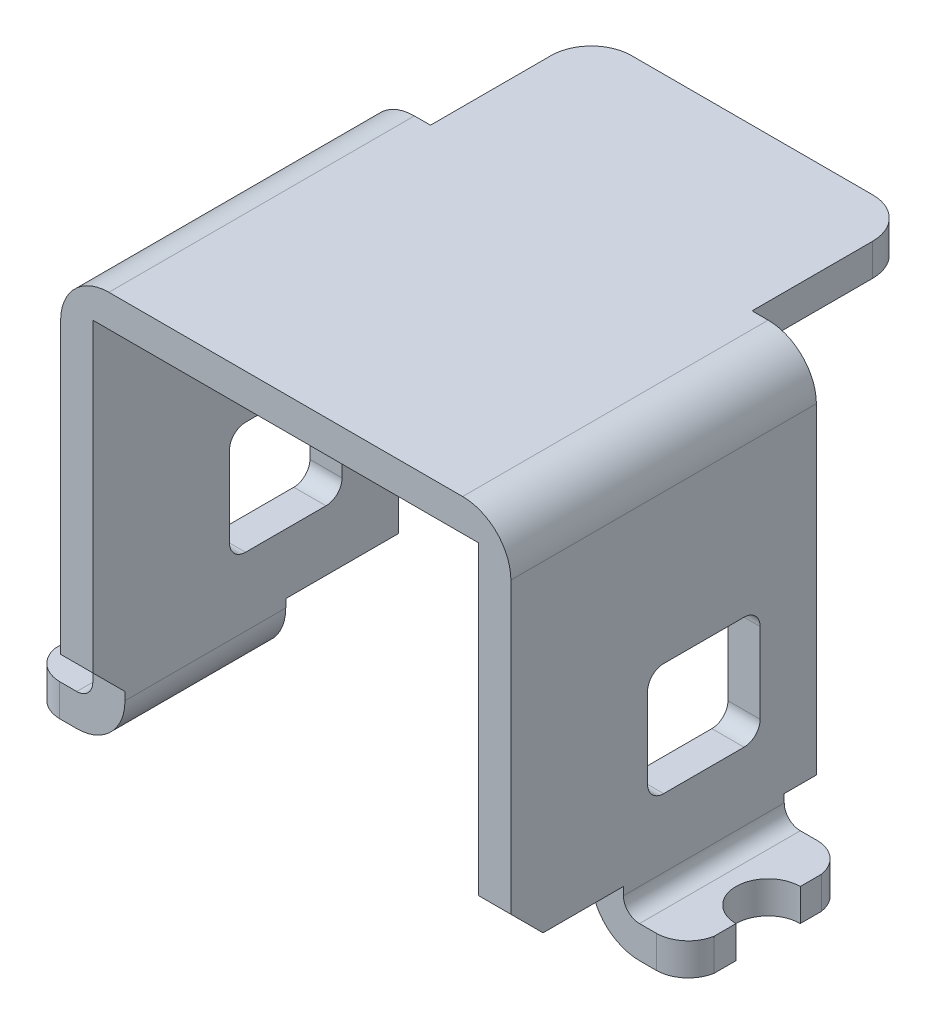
ISO-10303-21;
HEADER;
FILE_DESCRIPTION(('STEP AP214'),'2;1');
FILE_NAME('part.step','',(''),(''),'','','');
FILE_SCHEMA(('AUTOMOTIVE_DESIGN { 1 0 10303 214 1 1 1 1 }'));
ENDSEC;
DATA;
#1=APPLICATION_CONTEXT('core data for automotive mechanical design processes');
#2=APPLICATION_PROTOCOL_DEFINITION('international standard','automotive_design',2000,#1);
#3=PRODUCT_CONTEXT('',#1,'mechanical');
#4=PRODUCT('Part','Part','',(#3));
#5=PRODUCT_RELATED_PRODUCT_CATEGORY('part','',(#4));
#6=PRODUCT_DEFINITION_FORMATION('','',#4);
#7=PRODUCT_DEFINITION_CONTEXT('part definition',#1,'design');
#8=PRODUCT_DEFINITION('design','',#6,#7);
#9=PRODUCT_DEFINITION_SHAPE('','',#8);
#10=(LENGTH_UNIT() NAMED_UNIT(*) SI_UNIT(.MILLI.,.METRE.));
#11=(NAMED_UNIT(*) PLANE_ANGLE_UNIT() SI_UNIT($,.RADIAN.));
#12=(NAMED_UNIT(*) SI_UNIT($,.STERADIAN.) SOLID_ANGLE_UNIT());
#13=UNCERTAINTY_MEASURE_WITH_UNIT(LENGTH_MEASURE(1.E-05),#10,'distance_accuracy_value','');
#14=(GEOMETRIC_REPRESENTATION_CONTEXT(3) GLOBAL_UNCERTAINTY_ASSIGNED_CONTEXT((#13)) GLOBAL_UNIT_ASSIGNED_CONTEXT((#10,
#11,#12)) REPRESENTATION_CONTEXT('',''));
#15=CARTESIAN_POINT('',(0.,0.,0.));
#16=DIRECTION('',(0.,0.,1.));
#17=DIRECTION('',(1.,0.,0.));
#18=AXIS2_PLACEMENT_3D('',#15,#16,#17);
#19=CARTESIAN_POINT('',(-3.6,-0.0999999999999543,-2.5));
#20=DIRECTION('',(-1.,0.,0.));
#21=DIRECTION('',(0.,0.,1.));
#22=AXIS2_PLACEMENT_3D('',#19,#20,#21);
#23=PLANE('',#22);
#24=DIRECTION('',(0.,-1.,0.));
#25=VECTOR('',#24,1.);
#26=CARTESIAN_POINT('',(-3.6,-0.8,-2.82633336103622));
#27=LINE('',#26,#25);
#28=CARTESIAN_POINT('',(-3.6,0.300000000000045,-2.82633336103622));
#29=VERTEX_POINT('',#28);
#30=CARTESIAN_POINT('',(-3.6,-0.0999999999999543,-2.82633336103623));
#31=VERTEX_POINT('',#30);
#32=EDGE_CURVE('E41',#29,#31,#27,.T.);
#33=ORIENTED_EDGE('',*,*,#32,.F.);
#34=DIRECTION('',(0.,0.,-1.));
#35=VECTOR('',#34,1.);
#36=CARTESIAN_POINT('',(-3.6,0.300000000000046,-2.5));
#37=LINE('',#36,#35);
#38=CARTESIAN_POINT('',(-3.6,0.300000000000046,-3.10000000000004));
#39=VERTEX_POINT('',#38);
#40=EDGE_CURVE('E11',#29,#39,#37,.T.);
#41=ORIENTED_EDGE('',*,*,#40,.T.);
#42=DIRECTION('',(0.,1.,0.));
#43=VECTOR('',#42,1.);
#44=CARTESIAN_POINT('',(-3.6,-0.8,-3.10000000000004));
#45=LINE('',#44,#43);
#46=CARTESIAN_POINT('',(-3.6,-0.0999999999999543,-3.10000000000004));
#47=VERTEX_POINT('',#46);
#48=EDGE_CURVE('E410',#47,#39,#45,.T.);
#49=ORIENTED_EDGE('',*,*,#48,.F.);
#50=DIRECTION('',(0.,0.,1.));
#51=VECTOR('',#50,1.);
#52=CARTESIAN_POINT('',(-3.6,-0.0999999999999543,-2.5));
#53=LINE('',#52,#51);
#54=EDGE_CURVE('E27',#47,#31,#53,.T.);
#55=ORIENTED_EDGE('',*,*,#54,.T.);
#56=EDGE_LOOP('',(#33,#41,#49,#55));
#57=FACE_BOUND('',#56,.T.);
#58=ADVANCED_FACE('F16',(#57),#23,.T.);
#59=CARTESIAN_POINT('',(1.,4.8,-8.));
#60=DIRECTION('',(0.,-1.,0.));
#61=DIRECTION('',(0.,0.,-1.));
#62=AXIS2_PLACEMENT_3D('',#59,#60,#61);
#63=PLANE('',#62);
#64=DIRECTION('',(1.,0.,0.));
#65=VECTOR('',#64,1.);
#66=CARTESIAN_POINT('',(2.8,4.8,-2.1));
#67=LINE('',#66,#65);
#68=CARTESIAN_POINT('',(-2.4,4.8,-2.10000000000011));
#69=VERTEX_POINT('',#68);
#70=CARTESIAN_POINT('',(2.4,4.8,-2.10000000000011));
#71=VERTEX_POINT('',#70);
#72=EDGE_CURVE('E358',#69,#71,#67,.T.);
#73=ORIENTED_EDGE('',*,*,#72,.F.);
#74=DIRECTION('',(0.,0.,-1.));
#75=VECTOR('',#74,1.);
#76=CARTESIAN_POINT('',(-2.4,4.8,-8.));
#77=LINE('',#76,#75);
#78=CARTESIAN_POINT('',(-2.4,4.8,-5.90000000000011));
#79=VERTEX_POINT('',#78);
#80=EDGE_CURVE('E519',#69,#79,#77,.T.);
#81=ORIENTED_EDGE('',*,*,#80,.T.);
#82=DIRECTION('',(-1.,0.,0.));
#83=VECTOR('',#82,1.);
#84=CARTESIAN_POINT('',(-2.00000000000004,4.8,-5.9));
#85=LINE('',#84,#83);
#86=CARTESIAN_POINT('',(-2.00000000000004,4.8,-5.9));
#87=VERTEX_POINT('',#86);
#88=EDGE_CURVE('E339',#87,#79,#85,.T.);
#89=ORIENTED_EDGE('',*,*,#88,.F.);
#90=DIRECTION('',(0.,0.,1.));
#91=VECTOR('',#90,1.);
#92=CARTESIAN_POINT('',(-2.00000000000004,4.8,-5.9));
#93=LINE('',#92,#91);
#94=CARTESIAN_POINT('',(-2.00000000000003,4.8,-7.4));
#95=VERTEX_POINT('',#94);
#96=EDGE_CURVE('E416',#95,#87,#93,.T.);
#97=ORIENTED_EDGE('',*,*,#96,.F.);
#98=CARTESIAN_POINT('',(-1.50000000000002,4.8,-7.4));
#99=DIRECTION('',(0.,1.,0.));
#100=DIRECTION('',(0.,0.,-1.));
#101=AXIS2_PLACEMENT_3D('',#98,#99,#100);
#102=CIRCLE('',#101,0.5);
#103=CARTESIAN_POINT('',(-1.50000000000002,4.8,-7.9));
#104=VERTEX_POINT('',#103);
#105=EDGE_CURVE('E579',#104,#95,#102,.T.);
#106=ORIENTED_EDGE('',*,*,#105,.F.);
#107=DIRECTION('',(-1.,0.,0.));
#108=VECTOR('',#107,1.);
#109=CARTESIAN_POINT('',(-1.50000000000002,4.8,-7.9));
#110=LINE('',#109,#108);
#111=CARTESIAN_POINT('',(1.5,4.8,-7.9));
#112=VERTEX_POINT('',#111);
#113=EDGE_CURVE('E534',#112,#104,#110,.T.);
#114=ORIENTED_EDGE('',*,*,#113,.F.);
#115=CARTESIAN_POINT('',(1.5,4.8,-7.4));
#116=DIRECTION('',(0.,1.,0.));
#117=DIRECTION('',(0.,0.,-1.));
#118=AXIS2_PLACEMENT_3D('',#115,#116,#117);
#119=CIRCLE('',#118,0.5);
#120=CARTESIAN_POINT('',(2.,4.8,-7.4));
#121=VERTEX_POINT('',#120);
#122=EDGE_CURVE('E452',#121,#112,#119,.T.);
#123=ORIENTED_EDGE('',*,*,#122,.F.);
#124=DIRECTION('',(0.,0.,-1.));
#125=VECTOR('',#124,1.);
#126=CARTESIAN_POINT('',(2.,4.8,-7.4));
#127=LINE('',#126,#125);
#128=CARTESIAN_POINT('',(2.,4.8,-5.9));
#129=VERTEX_POINT('',#128);
#130=EDGE_CURVE('E357',#129,#121,#127,.T.);
#131=ORIENTED_EDGE('',*,*,#130,.F.);
#132=DIRECTION('',(-1.,0.,0.));
#133=VECTOR('',#132,1.);
#134=CARTESIAN_POINT('',(2.8,4.8,-5.9));
#135=LINE('',#134,#133);
#136=CARTESIAN_POINT('',(2.4,4.8,-5.9));
#137=VERTEX_POINT('',#136);
#138=EDGE_CURVE('E381',#137,#129,#135,.T.);
#139=ORIENTED_EDGE('',*,*,#138,.F.);
#140=DIRECTION('',(0.,0.,1.));
#141=VECTOR('',#140,1.);
#142=CARTESIAN_POINT('',(2.4,4.8,-8.));
#143=LINE('',#142,#141);
#144=EDGE_CURVE('E523',#137,#71,#143,.T.);
#145=ORIENTED_EDGE('',*,*,#144,.T.);
#146=EDGE_LOOP('',(#73,#81,#89,#97,#106,#114,#123,#131,#139,#145));
#147=FACE_BOUND('',#146,.T.);
#148=ADVANCED_FACE('F1135',(#147),#63,.T.);
#149=CARTESIAN_POINT('',(2.4,-0.0999999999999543,-3.50000000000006));
#150=DIRECTION('',(0.,-1.,0.));
#151=DIRECTION('',(0.,0.,-1.));
#152=AXIS2_PLACEMENT_3D('',#149,#150,#151);
#153=PLANE('',#152);
#154=DIRECTION('',(1.,0.,0.));
#155=VECTOR('',#154,1.);
#156=CARTESIAN_POINT('',(2.4,-0.0999999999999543,-3.50000000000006));
#157=LINE('',#156,#155);
#158=CARTESIAN_POINT('',(3.,-0.0999999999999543,-3.50000000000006));
#159=VERTEX_POINT('',#158);
#160=CARTESIAN_POINT('',(3.21335362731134,-0.0999999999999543,-3.50000000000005));
#161=VERTEX_POINT('',#160);
#162=EDGE_CURVE('E320',#159,#161,#157,.T.);
#163=ORIENTED_EDGE('',*,*,#162,.F.);
#164=DIRECTION('',(0.,0.,-1.));
#165=VECTOR('',#164,1.);
#166=CARTESIAN_POINT('',(3.,-0.0999999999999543,-5.5));
#167=LINE('',#166,#165);
#168=CARTESIAN_POINT('',(3.,-0.0999999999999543,-5.5));
#169=VERTEX_POINT('',#168);
#170=EDGE_CURVE('E686',#159,#169,#167,.T.);
#171=ORIENTED_EDGE('',*,*,#170,.T.);
#172=DIRECTION('',(1.,0.,0.));
#173=VECTOR('',#172,1.);
#174=CARTESIAN_POINT('',(2.4,-0.0999999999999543,-5.5));
#175=LINE('',#174,#173);
#176=CARTESIAN_POINT('',(3.22808084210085,-0.0999999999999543,-5.5));
#177=VERTEX_POINT('',#176);
#178=EDGE_CURVE('E682',#169,#177,#175,.T.);
#179=ORIENTED_EDGE('',*,*,#178,.T.);
#180=CARTESIAN_POINT('',(3.20478861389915,-0.0999999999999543,-5.10067873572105));
#181=DIRECTION('',(0.,1.,0.));
#182=DIRECTION('',(0.,0.,-1.));
#183=AXIS2_PLACEMENT_3D('',#180,#181,#182);
#184=CIRCLE('',#183,0.399999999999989);
#185=CARTESIAN_POINT('',(3.6,-0.0999999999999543,-5.16238740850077));
#186=VERTEX_POINT('',#185);
#187=EDGE_CURVE('E389',#186,#177,#184,.T.);
#188=ORIENTED_EDGE('',*,*,#187,.F.);
#189=DIRECTION('',(0.,0.,-1.));
#190=VECTOR('',#189,1.);
#191=CARTESIAN_POINT('',(3.6,-0.0999999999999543,-5.5));
#192=LINE('',#191,#190);
#193=CARTESIAN_POINT('',(3.6,-0.0999999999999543,-4.90000000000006));
#194=VERTEX_POINT('',#193);
#195=EDGE_CURVE('E471',#194,#186,#192,.T.);
#196=ORIENTED_EDGE('',*,*,#195,.F.);
#197=CARTESIAN_POINT('',(3.6,-0.0999999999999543,-4.50000000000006));
#198=DIRECTION('',(0.,1.,0.));
#199=DIRECTION('',(0.,0.,-1.));
#200=AXIS2_PLACEMENT_3D('',#197,#198,#199);
#201=CIRCLE('',#200,0.4);
#202=CARTESIAN_POINT('',(3.6,-0.0999999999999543,-4.10000000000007));
#203=VERTEX_POINT('',#202);
#204=EDGE_CURVE('E687',#194,#203,#201,.T.);
#205=ORIENTED_EDGE('',*,*,#204,.T.);
#206=DIRECTION('',(0.,0.,-1.));
#207=VECTOR('',#206,1.);
#208=CARTESIAN_POINT('',(3.6,-0.0999999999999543,-5.5));
#209=LINE('',#208,#207);
#210=CARTESIAN_POINT('',(3.6,-0.0999999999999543,-3.82633336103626));
#211=VERTEX_POINT('',#210);
#212=EDGE_CURVE('E292',#211,#203,#209,.T.);
#213=ORIENTED_EDGE('',*,*,#212,.F.);
#214=CARTESIAN_POINT('',(3.20683202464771,-0.0999999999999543,-3.89994683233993));
#215=DIRECTION('',(0.,1.,0.));
#216=DIRECTION('',(0.,0.,-1.));
#217=AXIS2_PLACEMENT_3D('',#214,#215,#216);
#218=CIRCLE('',#217,0.4);
#219=EDGE_CURVE('E385',#161,#211,#218,.T.);
#220=ORIENTED_EDGE('',*,*,#219,.F.);
#221=EDGE_LOOP('',(#163,#171,#179,#188,#196,#205,#213,#220));
#222=FACE_BOUND('',#221,.T.);
#223=ADVANCED_FACE('F1681',(#222),#153,.T.);
#224=CARTESIAN_POINT('',(3.6,0.300000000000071,-5.5));
#225=DIRECTION('',(0.,-1.,0.));
#226=DIRECTION('',(0.,0.,-1.));
#227=AXIS2_PLACEMENT_3D('',#224,#225,#226);
#228=PLANE('',#227);
#229=DIRECTION('',(-1.,0.,0.));
#230=VECTOR('',#229,1.);
#231=CARTESIAN_POINT('',(3.6,0.300000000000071,-5.5));
#232=LINE('',#231,#230);
#233=CARTESIAN_POINT('',(3.22808084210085,0.300000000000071,-5.5));
#234=VERTEX_POINT('',#233);
#235=CARTESIAN_POINT('',(3.,0.300000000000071,-5.5));
#236=VERTEX_POINT('',#235);
#237=EDGE_CURVE('E804',#234,#236,#232,.T.);
#238=ORIENTED_EDGE('',*,*,#237,.T.);
#239=DIRECTION('',(0.,0.,1.));
#240=VECTOR('',#239,1.);
#241=CARTESIAN_POINT('',(3.,0.300000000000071,-5.5));
#242=LINE('',#241,#240);
#243=CARTESIAN_POINT('',(3.,0.300000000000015,-3.50000000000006));
#244=VERTEX_POINT('',#243);
#245=EDGE_CURVE('E350',#236,#244,#242,.T.);
#246=ORIENTED_EDGE('',*,*,#245,.T.);
#247=DIRECTION('',(-1.,0.,0.));
#248=VECTOR('',#247,1.);
#249=CARTESIAN_POINT('',(3.6,0.300000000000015,-3.50000000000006));
#250=LINE('',#249,#248);
#251=CARTESIAN_POINT('',(3.21335362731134,0.300000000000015,-3.50000000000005));
#252=VERTEX_POINT('',#251);
#253=EDGE_CURVE('E316',#252,#244,#250,.T.);
#254=ORIENTED_EDGE('',*,*,#253,.F.);
#255=CARTESIAN_POINT('',(3.20683202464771,0.300000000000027,-3.89994683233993));
#256=DIRECTION('',(0.,1.,0.));
#257=DIRECTION('',(0.,0.,-1.));
#258=AXIS2_PLACEMENT_3D('',#255,#256,#257);
#259=CIRCLE('',#258,0.4);
#260=CARTESIAN_POINT('',(3.6,0.300000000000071,-3.82633336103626));
#261=VERTEX_POINT('',#260);
#262=EDGE_CURVE('E346',#252,#261,#259,.T.);
#263=ORIENTED_EDGE('',*,*,#262,.T.);
#264=DIRECTION('',(0.,0.,1.));
#265=VECTOR('',#264,1.);
#266=CARTESIAN_POINT('',(3.6,0.300000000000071,-5.5));
#267=LINE('',#266,#265);
#268=CARTESIAN_POINT('',(3.6,0.300000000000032,-4.10000000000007));
#269=VERTEX_POINT('',#268);
#270=EDGE_CURVE('E2734',#269,#261,#267,.T.);
#271=ORIENTED_EDGE('',*,*,#270,.F.);
#272=CARTESIAN_POINT('',(3.6,0.300000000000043,-4.50000000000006));
#273=DIRECTION('',(0.,1.,0.));
#274=DIRECTION('',(0.,0.,-1.));
#275=AXIS2_PLACEMENT_3D('',#272,#273,#274);
#276=CIRCLE('',#275,0.4);
#277=CARTESIAN_POINT('',(3.6,0.300000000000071,-4.90000000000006));
#278=VERTEX_POINT('',#277);
#279=EDGE_CURVE('E467',#278,#269,#276,.T.);
#280=ORIENTED_EDGE('',*,*,#279,.F.);
#281=DIRECTION('',(0.,0.,1.));
#282=VECTOR('',#281,1.);
#283=CARTESIAN_POINT('',(3.6,0.300000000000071,-5.5));
#284=LINE('',#283,#282);
#285=CARTESIAN_POINT('',(3.6,0.300000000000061,-5.16238740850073));
#286=VERTEX_POINT('',#285);
#287=EDGE_CURVE('E859',#286,#278,#284,.T.);
#288=ORIENTED_EDGE('',*,*,#287,.F.);
#289=CARTESIAN_POINT('',(3.20478861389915,0.30000000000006,-5.10067873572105));
#290=DIRECTION('',(0.,1.,0.));
#291=DIRECTION('',(0.,0.,-1.));
#292=AXIS2_PLACEMENT_3D('',#289,#290,#291);
#293=CIRCLE('',#292,0.399999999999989);
#294=EDGE_CURVE('E351',#286,#234,#293,.T.);
#295=ORIENTED_EDGE('',*,*,#294,.T.);
#296=EDGE_LOOP('',(#238,#246,#254,#263,#271,#280,#288,#295));
#297=FACE_BOUND('',#296,.T.);
#298=ADVANCED_FACE('F1676',(#297),#228,.F.);
#299=CARTESIAN_POINT('',(3.6,-0.0999999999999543,-5.5));
#300=DIRECTION('',(-1.,0.,0.));
#301=DIRECTION('',(0.,0.,1.));
#302=AXIS2_PLACEMENT_3D('',#299,#300,#301);
#303=PLANE('',#302);
#304=DIRECTION('',(0.,1.,0.));
#305=VECTOR('',#304,1.);
#306=CARTESIAN_POINT('',(3.6,5.2,-4.90000000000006));
#307=LINE('',#306,#305);
#308=EDGE_CURVE('E463',#194,#278,#307,.T.);
#309=ORIENTED_EDGE('',*,*,#308,.F.);
#310=ORIENTED_EDGE('',*,*,#195,.T.);
#311=DIRECTION('',(0.,1.,0.));
#312=VECTOR('',#311,1.);
#313=CARTESIAN_POINT('',(3.6,5.2,-5.16238740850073));
#314=LINE('',#313,#312);
#315=EDGE_CURVE('E475',#186,#286,#314,.T.);
#316=ORIENTED_EDGE('',*,*,#315,.T.);
#317=ORIENTED_EDGE('',*,*,#287,.T.);
#318=EDGE_LOOP('',(#309,#310,#316,#317));
#319=FACE_BOUND('',#318,.T.);
#320=ADVANCED_FACE('F1680',(#319),#303,.F.);
#321=CARTESIAN_POINT('',(3.6,-0.0999999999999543,-5.5));
#322=DIRECTION('',(-1.,0.,0.));
#323=DIRECTION('',(0.,0.,1.));
#324=AXIS2_PLACEMENT_3D('',#321,#322,#323);
#325=PLANE('',#324);
#326=DIRECTION('',(0.,-1.,0.));
#327=VECTOR('',#326,1.);
#328=CARTESIAN_POINT('',(3.6,5.2,-4.10000000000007));
#329=LINE('',#328,#327);
#330=EDGE_CURVE('E308',#269,#203,#329,.T.);
#331=ORIENTED_EDGE('',*,*,#330,.F.);
#332=ORIENTED_EDGE('',*,*,#270,.T.);
#333=DIRECTION('',(0.,-1.,0.));
#334=VECTOR('',#333,1.);
#335=CARTESIAN_POINT('',(3.6,5.2,-3.82633336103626));
#336=LINE('',#335,#334);
#337=EDGE_CURVE('E296',#261,#211,#336,.T.);
#338=ORIENTED_EDGE('',*,*,#337,.T.);
#339=ORIENTED_EDGE('',*,*,#212,.T.);
#340=EDGE_LOOP('',(#331,#332,#338,#339));
#341=FACE_BOUND('',#340,.T.);
#342=ADVANCED_FACE('F1690',(#341),#325,.F.);
#343=CARTESIAN_POINT('',(2.4,0.600000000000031,-2.50000000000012));
#344=DIRECTION('',(0.,-1.,0.));
#345=DIRECTION('',(0.,0.,-1.));
#346=AXIS2_PLACEMENT_3D('',#343,#344,#345);
#347=PLANE('',#346);
#348=DIRECTION('',(0.,0.,-1.));
#349=VECTOR('',#348,1.);
#350=CARTESIAN_POINT('',(2.4,0.600000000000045,-5.5));
#351=LINE('',#350,#349);
#352=CARTESIAN_POINT('',(2.4,0.600000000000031,-2.50000000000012));
#353=VERTEX_POINT('',#352);
#354=CARTESIAN_POINT('',(2.4,0.600000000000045,-3.50000000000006));
#355=VERTEX_POINT('',#354);
#356=EDGE_CURVE('E297',#353,#355,#351,.T.);
#357=ORIENTED_EDGE('',*,*,#356,.T.);
#358=DIRECTION('',(1.,0.,0.));
#359=VECTOR('',#358,1.);
#360=CARTESIAN_POINT('',(2.4,0.600000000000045,-3.50000000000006));
#361=LINE('',#360,#359);
#362=CARTESIAN_POINT('',(2.8,0.600000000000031,-3.50000000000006));
#363=VERTEX_POINT('',#362);
#364=EDGE_CURVE('E344',#355,#363,#361,.T.);
#365=ORIENTED_EDGE('',*,*,#364,.T.);
#366=DIRECTION('',(0.,0.,-1.));
#367=VECTOR('',#366,1.);
#368=CARTESIAN_POINT('',(2.8,0.600000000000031,-2.50000000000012));
#369=LINE('',#368,#367);
#370=CARTESIAN_POINT('',(2.8,0.600000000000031,-2.50000000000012));
#371=VERTEX_POINT('',#370);
#372=EDGE_CURVE('E650',#371,#363,#369,.T.);
#373=ORIENTED_EDGE('',*,*,#372,.F.);
#374=DIRECTION('',(1.,0.,0.));
#375=VECTOR('',#374,1.);
#376=CARTESIAN_POINT('',(2.4,0.600000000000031,-2.50000000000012));
#377=LINE('',#376,#375);
#378=EDGE_CURVE('E603',#353,#371,#377,.T.);
#379=ORIENTED_EDGE('',*,*,#378,.F.);
#380=EDGE_LOOP('',(#357,#365,#373,#379));
#381=FACE_BOUND('',#380,.T.);
#382=ADVANCED_FACE('F1694',(#381),#347,.T.);
#383=CARTESIAN_POINT('',(1.5,5.2,-7.4));
#384=DIRECTION('',(0.,1.,0.));
#385=DIRECTION('',(1.,0.,0.));
#386=AXIS2_PLACEMENT_3D('',#383,#384,#385);
#387=PLANE('',#386);
#388=DIRECTION('',(-1.,0.,0.));
#389=VECTOR('',#388,1.);
#390=CARTESIAN_POINT('',(-2.00000000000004,5.2,-5.9));
#391=LINE('',#390,#389);
#392=CARTESIAN_POINT('',(-2.00000000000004,5.2,-5.9));
#393=VERTEX_POINT('',#392);
#394=CARTESIAN_POINT('',(-2.2,5.2,-5.9));
#395=VERTEX_POINT('',#394);
#396=EDGE_CURVE('E340',#393,#395,#391,.T.);
#397=ORIENTED_EDGE('',*,*,#396,.T.);
#398=DIRECTION('',(0.,0.,1.));
#399=VECTOR('',#398,1.);
#400=CARTESIAN_POINT('',(-2.2,5.2,-7.4));
#401=LINE('',#400,#399);
#402=CARTESIAN_POINT('',(-2.2,5.2,-2.1));
#403=VERTEX_POINT('',#402);
#404=EDGE_CURVE('E345',#395,#403,#401,.T.);
#405=ORIENTED_EDGE('',*,*,#404,.T.);
#406=DIRECTION('',(1.,0.,0.));
#407=VECTOR('',#406,1.);
#408=CARTESIAN_POINT('',(2.8,5.2,-2.1));
#409=LINE('',#408,#407);
#410=CARTESIAN_POINT('',(2.2,5.2,-2.1));
#411=VERTEX_POINT('',#410);
#412=EDGE_CURVE('E479',#403,#411,#409,.T.);
#413=ORIENTED_EDGE('',*,*,#412,.T.);
#414=DIRECTION('',(0.,0.,-1.));
#415=VECTOR('',#414,1.);
#416=CARTESIAN_POINT('',(2.2,5.2,-7.4));
#417=LINE('',#416,#415);
#418=CARTESIAN_POINT('',(2.2,5.2,-5.9));
#419=VERTEX_POINT('',#418);
#420=EDGE_CURVE('E552',#411,#419,#417,.T.);
#421=ORIENTED_EDGE('',*,*,#420,.T.);
#422=DIRECTION('',(-1.,0.,0.));
#423=VECTOR('',#422,1.);
#424=CARTESIAN_POINT('',(2.8,5.2,-5.9));
#425=LINE('',#424,#423);
#426=CARTESIAN_POINT('',(2.,5.2,-5.9));
#427=VERTEX_POINT('',#426);
#428=EDGE_CURVE('E548',#419,#427,#425,.T.);
#429=ORIENTED_EDGE('',*,*,#428,.T.);
#430=DIRECTION('',(0.,0.,-1.));
#431=VECTOR('',#430,1.);
#432=CARTESIAN_POINT('',(2.,5.2,-7.4));
#433=LINE('',#432,#431);
#434=CARTESIAN_POINT('',(2.,5.2,-7.4));
#435=VERTEX_POINT('',#434);
#436=EDGE_CURVE('E553',#427,#435,#433,.T.);
#437=ORIENTED_EDGE('',*,*,#436,.T.);
#438=CARTESIAN_POINT('',(1.5,5.2,-7.4));
#439=DIRECTION('',(0.,1.,0.));
#440=DIRECTION('',(0.,0.,1.));
#441=AXIS2_PLACEMENT_3D('',#438,#439,#440);
#442=CIRCLE('',#441,0.5);
#443=CARTESIAN_POINT('',(1.5,5.2,-7.9));
#444=VERTEX_POINT('',#443);
#445=EDGE_CURVE('E623',#435,#444,#442,.T.);
#446=ORIENTED_EDGE('',*,*,#445,.T.);
#447=DIRECTION('',(-1.,0.,0.));
#448=VECTOR('',#447,1.);
#449=CARTESIAN_POINT('',(-1.50000000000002,5.2,-7.9));
#450=LINE('',#449,#448);
#451=CARTESIAN_POINT('',(-1.50000000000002,5.2,-7.9));
#452=VERTEX_POINT('',#451);
#453=EDGE_CURVE('E619',#444,#452,#450,.T.);
#454=ORIENTED_EDGE('',*,*,#453,.T.);
#455=CARTESIAN_POINT('',(-1.50000000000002,5.2,-7.4));
#456=DIRECTION('',(0.,1.,0.));
#457=DIRECTION('',(0.,0.,1.));
#458=AXIS2_PLACEMENT_3D('',#455,#456,#457);
#459=CIRCLE('',#458,0.5);
#460=CARTESIAN_POINT('',(-2.00000000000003,5.2,-7.4));
#461=VERTEX_POINT('',#460);
#462=EDGE_CURVE('E356',#452,#461,#459,.T.);
#463=ORIENTED_EDGE('',*,*,#462,.T.);
#464=DIRECTION('',(0.,0.,1.));
#465=VECTOR('',#464,1.);
#466=CARTESIAN_POINT('',(-2.00000000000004,5.2,-5.9));
#467=LINE('',#466,#465);
#468=EDGE_CURVE('E352',#461,#393,#467,.T.);
#469=ORIENTED_EDGE('',*,*,#468,.T.);
#470=EDGE_LOOP('',(#397,#405,#413,#421,#429,#437,#446,#454,#463,#469));
#471=FACE_BOUND('',#470,.T.);
#472=ADVANCED_FACE('F1126',(#471),#387,.T.);
#473=CARTESIAN_POINT('',(2.,-3.26225774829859,-7.4));
#474=DIRECTION('',(1.,0.,0.));
#475=DIRECTION('',(0.,0.,1.));
#476=AXIS2_PLACEMENT_3D('',#473,#474,#475);
#477=PLANE('',#476);
#478=DIRECTION('',(0.,1.,0.));
#479=VECTOR('',#478,1.);
#480=CARTESIAN_POINT('',(2.,-3.26225774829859,-5.9));
#481=LINE('',#480,#479);
#482=EDGE_CURVE('E701',#129,#427,#481,.T.);
#483=ORIENTED_EDGE('',*,*,#482,.F.);
#484=ORIENTED_EDGE('',*,*,#130,.T.);
#485=DIRECTION('',(0.,1.,0.));
#486=VECTOR('',#485,1.);
#487=CARTESIAN_POINT('',(2.,-3.26225774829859,-7.4));
#488=LINE('',#487,#486);
#489=EDGE_CURVE('E456',#121,#435,#488,.T.);
#490=ORIENTED_EDGE('',*,*,#489,.T.);
#491=ORIENTED_EDGE('',*,*,#436,.F.);
#492=EDGE_LOOP('',(#483,#484,#490,#491));
#493=FACE_BOUND('',#492,.T.);
#494=ADVANCED_FACE('F1840',(#493),#477,.T.);
#495=CARTESIAN_POINT('',(1.5,-3.26225774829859,-7.4));
#496=DIRECTION('',(0.,1.,0.));
#497=DIRECTION('',(0.,0.,1.));
#498=AXIS2_PLACEMENT_3D('',#495,#496,#497);
#499=CYLINDRICAL_SURFACE('',#498,0.5);
#500=ORIENTED_EDGE('',*,*,#489,.F.);
#501=ORIENTED_EDGE('',*,*,#122,.T.);
#502=DIRECTION('',(0.,1.,0.));
#503=VECTOR('',#502,1.);
#504=CARTESIAN_POINT('',(1.5,-3.26225774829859,-7.9));
#505=LINE('',#504,#503);
#506=EDGE_CURVE('E457',#112,#444,#505,.T.);
#507=ORIENTED_EDGE('',*,*,#506,.T.);
#508=ORIENTED_EDGE('',*,*,#445,.F.);
#509=EDGE_LOOP('',(#500,#501,#507,#508));
#510=FACE_BOUND('',#509,.T.);
#511=ADVANCED_FACE('F1785',(#510),#499,.T.);
#512=CARTESIAN_POINT('',(-1.50000000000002,-3.26225774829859,-7.9));
#513=DIRECTION('',(0.,0.,-1.));
#514=DIRECTION('',(0.,-1.,0.));
#515=AXIS2_PLACEMENT_3D('',#512,#513,#514);
#516=PLANE('',#515);
#517=ORIENTED_EDGE('',*,*,#506,.F.);
#518=ORIENTED_EDGE('',*,*,#113,.T.);
#519=DIRECTION('',(0.,1.,0.));
#520=VECTOR('',#519,1.);
#521=CARTESIAN_POINT('',(-1.50000000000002,-3.26225774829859,-7.9));
#522=LINE('',#521,#520);
#523=EDGE_CURVE('E538',#104,#452,#522,.T.);
#524=ORIENTED_EDGE('',*,*,#523,.T.);
#525=ORIENTED_EDGE('',*,*,#453,.F.);
#526=EDGE_LOOP('',(#517,#518,#524,#525));
#527=FACE_BOUND('',#526,.T.);
#528=ADVANCED_FACE('F1141',(#527),#516,.T.);
#529=CARTESIAN_POINT('',(-1.50000000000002,-3.26225774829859,-7.4));
#530=DIRECTION('',(0.,1.,0.));
#531=DIRECTION('',(0.,0.,1.));
#532=AXIS2_PLACEMENT_3D('',#529,#530,#531);
#533=CYLINDRICAL_SURFACE('',#532,0.5);
#534=ORIENTED_EDGE('',*,*,#523,.F.);
#535=ORIENTED_EDGE('',*,*,#105,.T.);
#536=DIRECTION('',(0.,1.,0.));
#537=VECTOR('',#536,1.);
#538=CARTESIAN_POINT('',(-2.00000000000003,-3.26225774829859,-7.4));
#539=LINE('',#538,#537);
#540=EDGE_CURVE('E420',#95,#461,#539,.T.);
#541=ORIENTED_EDGE('',*,*,#540,.T.);
#542=ORIENTED_EDGE('',*,*,#462,.F.);
#543=EDGE_LOOP('',(#534,#535,#541,#542));
#544=FACE_BOUND('',#543,.T.);
#545=ADVANCED_FACE('F1138',(#544),#533,.T.);
#546=CARTESIAN_POINT('',(-2.00000000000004,-3.26225774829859,-5.9));
#547=DIRECTION('',(-1.,0.,0.));
#548=DIRECTION('',(0.,0.,1.));
#549=AXIS2_PLACEMENT_3D('',#546,#547,#548);
#550=PLANE('',#549);
#551=ORIENTED_EDGE('',*,*,#540,.F.);
#552=ORIENTED_EDGE('',*,*,#96,.T.);
#553=DIRECTION('',(0.,1.,0.));
#554=VECTOR('',#553,1.);
#555=CARTESIAN_POINT('',(-2.00000000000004,-3.26225774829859,-5.9));
#556=LINE('',#555,#554);
#557=EDGE_CURVE('E421',#87,#393,#556,.T.);
#558=ORIENTED_EDGE('',*,*,#557,.T.);
#559=ORIENTED_EDGE('',*,*,#468,.F.);
#560=EDGE_LOOP('',(#551,#552,#558,#559));
#561=FACE_BOUND('',#560,.T.);
#562=ADVANCED_FACE('F1133',(#561),#550,.T.);
#563=CARTESIAN_POINT('',(-2.00000000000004,-3.26225774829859,-5.9));
#564=DIRECTION('',(0.,0.,-1.));
#565=DIRECTION('',(0.,-1.,0.));
#566=AXIS2_PLACEMENT_3D('',#563,#564,#565);
#567=PLANE('',#566);
#568=DIRECTION('',(0.,1.,0.));
#569=VECTOR('',#568,1.);
#570=CARTESIAN_POINT('',(-2.8,-3.26225774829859,-5.9));
#571=LINE('',#570,#569);
#572=CARTESIAN_POINT('',(-2.8,0.600000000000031,-5.90000000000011));
#573=VERTEX_POINT('',#572);
#574=CARTESIAN_POINT('',(-2.8,4.6,-5.9));
#575=VERTEX_POINT('',#574);
#576=EDGE_CURVE('E338',#573,#575,#571,.T.);
#577=ORIENTED_EDGE('',*,*,#576,.T.);
#578=CARTESIAN_POINT('',(-2.2,4.6,-5.9));
#579=DIRECTION('',(0.,0.,-1.));
#580=DIRECTION('',(-1.,0.,0.));
#581=AXIS2_PLACEMENT_3D('',#578,#579,#580);
#582=CIRCLE('',#581,0.6);
#583=EDGE_CURVE('E334',#575,#395,#582,.T.);
#584=ORIENTED_EDGE('',*,*,#583,.T.);
#585=ORIENTED_EDGE('',*,*,#396,.F.);
#586=ORIENTED_EDGE('',*,*,#557,.F.);
#587=ORIENTED_EDGE('',*,*,#88,.T.);
#588=DIRECTION('',(0.,-1.,0.));
#589=VECTOR('',#588,1.);
#590=CARTESIAN_POINT('',(-2.4,5.20000000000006,-5.90000000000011));
#591=LINE('',#590,#589);
#592=CARTESIAN_POINT('',(-2.4,0.600000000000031,-5.90000000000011));
#593=VERTEX_POINT('',#592);
#594=EDGE_CURVE('E642',#79,#593,#591,.T.);
#595=ORIENTED_EDGE('',*,*,#594,.T.);
#596=DIRECTION('',(-1.,0.,0.));
#597=VECTOR('',#596,1.);
#598=CARTESIAN_POINT('',(-2.4,0.600000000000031,-5.90000000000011));
#599=LINE('',#598,#597);
#600=EDGE_CURVE('E646',#593,#573,#599,.T.);
#601=ORIENTED_EDGE('',*,*,#600,.T.);
#602=EDGE_LOOP('',(#577,#584,#585,#586,#587,#595,#601));
#603=FACE_BOUND('',#602,.T.);
#604=ADVANCED_FACE('F1132',(#603),#567,.T.);
#605=CARTESIAN_POINT('',(-2.8,-3.26225774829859,-5.9));
#606=DIRECTION('',(-1.,0.,0.));
#607=DIRECTION('',(0.,0.,1.));
#608=AXIS2_PLACEMENT_3D('',#605,#606,#607);
#609=PLANE('',#608);
#610=DIRECTION('',(0.,-1.,0.));
#611=VECTOR('',#610,1.);
#612=CARTESIAN_POINT('',(-2.8,0.600000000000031,-4.5));
#613=LINE('',#612,#611);
#614=CARTESIAN_POINT('',(-2.8,0.600000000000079,-4.5));
#615=VERTEX_POINT('',#614);
#616=CARTESIAN_POINT('',(-2.8,0.500000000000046,-4.5));
#617=VERTEX_POINT('',#616);
#618=EDGE_CURVE('E531',#615,#617,#613,.T.);
#619=ORIENTED_EDGE('',*,*,#618,.T.);
#620=DIRECTION('',(0.,0.,1.));
#621=VECTOR('',#620,1.);
#622=CARTESIAN_POINT('',(-2.8,0.500000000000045,-5.9));
#623=LINE('',#622,#621);
#624=CARTESIAN_POINT('',(-2.8,0.500000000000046,-2.5));
#625=VERTEX_POINT('',#624);
#626=EDGE_CURVE('E527',#617,#625,#623,.T.);
#627=ORIENTED_EDGE('',*,*,#626,.T.);
#628=DIRECTION('',(0.,1.,0.));
#629=VECTOR('',#628,1.);
#630=CARTESIAN_POINT('',(-2.8,0.600000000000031,-2.5));
#631=LINE('',#630,#629);
#632=CARTESIAN_POINT('',(-2.8,0.600000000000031,-2.5));
#633=VERTEX_POINT('',#632);
#634=EDGE_CURVE('E332',#625,#633,#631,.T.);
#635=ORIENTED_EDGE('',*,*,#634,.T.);
#636=DIRECTION('',(0.,0.707106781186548,0.707106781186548));
#637=VECTOR('',#636,1.);
#638=CARTESIAN_POINT('',(-2.8,0.600000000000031,-2.50000000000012));
#639=LINE('',#638,#637);
#640=CARTESIAN_POINT('',(-2.8,1.00000000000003,-2.10000000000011));
#641=VERTEX_POINT('',#640);
#642=EDGE_CURVE('E328',#633,#641,#639,.T.);
#643=ORIENTED_EDGE('',*,*,#642,.T.);
#644=DIRECTION('',(0.,1.,0.));
#645=VECTOR('',#644,1.);
#646=CARTESIAN_POINT('',(-2.8,-3.26225774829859,-2.1));
#647=LINE('',#646,#645);
#648=CARTESIAN_POINT('',(-2.8,4.6,-2.1));
#649=VERTEX_POINT('',#648);
#650=EDGE_CURVE('E333',#641,#649,#647,.T.);
#651=ORIENTED_EDGE('',*,*,#650,.T.);
#652=DIRECTION('',(0.,0.,-1.));
#653=VECTOR('',#652,1.);
#654=CARTESIAN_POINT('',(-2.8,4.6,-5.9));
#655=LINE('',#654,#653);
#656=EDGE_CURVE('E439',#649,#575,#655,.T.);
#657=ORIENTED_EDGE('',*,*,#656,.T.);
#658=ORIENTED_EDGE('',*,*,#576,.F.);
#659=DIRECTION('',(0.,0.,-1.));
#660=VECTOR('',#659,1.);
#661=CARTESIAN_POINT('',(-2.8,0.600000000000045,-5.5));
#662=LINE('',#661,#660);
#663=EDGE_CURVE('E627',#615,#573,#662,.T.);
#664=ORIENTED_EDGE('',*,*,#663,.F.);
#665=EDGE_LOOP('',(#619,#627,#635,#643,#651,#657,#658,#664));
#666=FACE_BOUND('',#665,.T.);
#667=DIRECTION('',(0.,-1.,0.));
#668=VECTOR('',#667,1.);
#669=CARTESIAN_POINT('',(-2.8,0.,-5.20000000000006));
#670=LINE('',#669,#668);
#671=CARTESIAN_POINT('',(-2.8,2.55000000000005,-5.20000000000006));
#672=VERTEX_POINT('',#671);
#673=CARTESIAN_POINT('',(-2.8,1.55000000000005,-5.20000000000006));
#674=VERTEX_POINT('',#673);
#675=EDGE_CURVE('E544',#672,#674,#670,.T.);
#676=ORIENTED_EDGE('',*,*,#675,.F.);
#677=CARTESIAN_POINT('',(-2.8,2.55000000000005,-5.00000000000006));
#678=DIRECTION('',(1.,0.,0.));
#679=DIRECTION('',(0.,0.,-1.));
#680=AXIS2_PLACEMENT_3D('',#677,#678,#679);
#681=CIRCLE('',#680,0.2);
#682=CARTESIAN_POINT('',(-2.8,2.75000000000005,-5.00000000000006));
#683=VERTEX_POINT('',#682);
#684=EDGE_CURVE('E374',#672,#683,#681,.T.);
#685=ORIENTED_EDGE('',*,*,#684,.T.);
#686=DIRECTION('',(0.,0.,-1.));
#687=VECTOR('',#686,1.);
#688=CARTESIAN_POINT('',(-2.8,2.75000000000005,0.));
#689=LINE('',#688,#687);
#690=CARTESIAN_POINT('',(-2.8,2.75000000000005,-4.));
#691=VERTEX_POINT('',#690);
#692=EDGE_CURVE('E364',#691,#683,#689,.T.);
#693=ORIENTED_EDGE('',*,*,#692,.F.);
#694=CARTESIAN_POINT('',(-2.8,2.55000000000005,-4.));
#695=DIRECTION('',(1.,0.,0.));
#696=DIRECTION('',(0.,0.,-1.));
#697=AXIS2_PLACEMENT_3D('',#694,#695,#696);
#698=CIRCLE('',#697,0.2);
#699=CARTESIAN_POINT('',(-2.8,2.55000000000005,-3.8));
#700=VERTEX_POINT('',#699);
#701=EDGE_CURVE('E370',#691,#700,#698,.T.);
#702=ORIENTED_EDGE('',*,*,#701,.T.);
#703=DIRECTION('',(0.,1.,0.));
#704=VECTOR('',#703,1.);
#705=CARTESIAN_POINT('',(-2.8,0.,-3.8));
#706=LINE('',#705,#704);
#707=CARTESIAN_POINT('',(-2.8,1.55000000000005,-3.8));
#708=VERTEX_POINT('',#707);
#709=EDGE_CURVE('E561',#708,#700,#706,.T.);
#710=ORIENTED_EDGE('',*,*,#709,.F.);
#711=CARTESIAN_POINT('',(-2.8,1.55000000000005,-4.));
#712=DIRECTION('',(1.,0.,0.));
#713=DIRECTION('',(0.,0.,-1.));
#714=AXIS2_PLACEMENT_3D('',#711,#712,#713);
#715=CIRCLE('',#714,0.2);
#716=CARTESIAN_POINT('',(-2.8,1.35000000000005,-4.));
#717=VERTEX_POINT('',#716);
#718=EDGE_CURVE('E375',#708,#717,#715,.T.);
#719=ORIENTED_EDGE('',*,*,#718,.T.);
#720=DIRECTION('',(0.,0.,1.));
#721=VECTOR('',#720,1.);
#722=CARTESIAN_POINT('',(-2.8,1.35000000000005,0.));
#723=LINE('',#722,#721);
#724=CARTESIAN_POINT('',(-2.8,1.35000000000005,-5.00000000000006));
#725=VERTEX_POINT('',#724);
#726=EDGE_CURVE('E578',#725,#717,#723,.T.);
#727=ORIENTED_EDGE('',*,*,#726,.F.);
#728=CARTESIAN_POINT('',(-2.8,1.55000000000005,-5.00000000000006));
#729=DIRECTION('',(1.,0.,0.));
#730=DIRECTION('',(0.,0.,-1.));
#731=AXIS2_PLACEMENT_3D('',#728,#729,#730);
#732=CIRCLE('',#731,0.2);
#733=EDGE_CURVE('E610',#725,#674,#732,.T.);
#734=ORIENTED_EDGE('',*,*,#733,.T.);
#735=EDGE_LOOP('',(#676,#685,#693,#702,#710,#719,#727,#734));
#736=FACE_BOUND('',#735,.T.);
#737=ADVANCED_FACE('F875',(#666,#736),#609,.T.);
#738=CARTESIAN_POINT('',(2.8,-3.26225774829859,-2.1));
#739=DIRECTION('',(0.,0.,1.));
#740=DIRECTION('',(1.,0.,0.));
#741=AXIS2_PLACEMENT_3D('',#738,#739,#740);
#742=PLANE('',#741);
#743=ORIENTED_EDGE('',*,*,#412,.F.);
#744=CARTESIAN_POINT('',(-2.2,4.6,-2.1));
#745=DIRECTION('',(0.,0.,1.));
#746=DIRECTION('',(1.,0.,0.));
#747=AXIS2_PLACEMENT_3D('',#744,#745,#746);
#748=CIRCLE('',#747,0.6);
#749=EDGE_CURVE('E362',#403,#649,#748,.T.);
#750=ORIENTED_EDGE('',*,*,#749,.T.);
#751=ORIENTED_EDGE('',*,*,#650,.F.);
#752=DIRECTION('',(-1.,0.,0.));
#753=VECTOR('',#752,1.);
#754=CARTESIAN_POINT('',(-2.4,1.00000000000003,-2.10000000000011));
#755=LINE('',#754,#753);
#756=CARTESIAN_POINT('',(-2.4,1.00000000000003,-2.10000000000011));
#757=VERTEX_POINT('',#756);
#758=EDGE_CURVE('E309',#757,#641,#755,.T.);
#759=ORIENTED_EDGE('',*,*,#758,.F.);
#760=DIRECTION('',(0.,-1.,0.));
#761=VECTOR('',#760,1.);
#762=CARTESIAN_POINT('',(-2.4,5.20000000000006,-2.10000000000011));
#763=LINE('',#762,#761);
#764=EDGE_CURVE('E411',#69,#757,#763,.T.);
#765=ORIENTED_EDGE('',*,*,#764,.F.);
#766=ORIENTED_EDGE('',*,*,#72,.T.);
#767=DIRECTION('',(0.,-1.,0.));
#768=VECTOR('',#767,1.);
#769=CARTESIAN_POINT('',(2.4,5.20000000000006,-2.10000000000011));
#770=LINE('',#769,#768);
#771=CARTESIAN_POINT('',(2.4,1.00000000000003,-2.10000000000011));
#772=VERTEX_POINT('',#771);
#773=EDGE_CURVE('E363',#71,#772,#770,.T.);
#774=ORIENTED_EDGE('',*,*,#773,.T.);
#775=DIRECTION('',(1.,0.,0.));
#776=VECTOR('',#775,1.);
#777=CARTESIAN_POINT('',(2.4,1.00000000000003,-2.10000000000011));
#778=LINE('',#777,#776);
#779=CARTESIAN_POINT('',(2.8,1.00000000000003,-2.10000000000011));
#780=VERTEX_POINT('',#779);
#781=EDGE_CURVE('E598',#772,#780,#778,.T.);
#782=ORIENTED_EDGE('',*,*,#781,.T.);
#783=DIRECTION('',(0.,1.,0.));
#784=VECTOR('',#783,1.);
#785=CARTESIAN_POINT('',(2.8,-3.26225774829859,-2.1));
#786=LINE('',#785,#784);
#787=CARTESIAN_POINT('',(2.8,4.6,-2.1));
#788=VERTEX_POINT('',#787);
#789=EDGE_CURVE('E763',#780,#788,#786,.T.);
#790=ORIENTED_EDGE('',*,*,#789,.T.);
#791=CARTESIAN_POINT('',(2.2,4.6,-2.1));
#792=DIRECTION('',(0.,0.,1.));
#793=DIRECTION('',(1.,0.,0.));
#794=AXIS2_PLACEMENT_3D('',#791,#792,#793);
#795=CIRCLE('',#794,0.6);
#796=EDGE_CURVE('E767',#788,#411,#795,.T.);
#797=ORIENTED_EDGE('',*,*,#796,.T.);
#798=EDGE_LOOP('',(#743,#750,#751,#759,#765,#766,#774,#782,#790,#797));
#799=FACE_BOUND('',#798,.T.);
#800=ADVANCED_FACE('F1763',(#799),#742,.T.);
#801=CARTESIAN_POINT('',(2.8,-3.26225774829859,-2.1));
#802=DIRECTION('',(1.,0.,0.));
#803=DIRECTION('',(0.,1.,0.));
#804=AXIS2_PLACEMENT_3D('',#801,#802,#803);
#805=PLANE('',#804);
#806=DIRECTION('',(0.,-1.,0.));
#807=VECTOR('',#806,1.);
#808=CARTESIAN_POINT('',(2.8,-0.0999999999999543,-3.50000000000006));
#809=LINE('',#808,#807);
#810=CARTESIAN_POINT('',(2.8,0.500000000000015,-3.50000000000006));
#811=VERTEX_POINT('',#810);
#812=EDGE_CURVE('E773',#363,#811,#809,.T.);
#813=ORIENTED_EDGE('',*,*,#812,.T.);
#814=DIRECTION('',(0.,0.,-1.));
#815=VECTOR('',#814,1.);
#816=CARTESIAN_POINT('',(2.8,0.499999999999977,-2.09999999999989));
#817=LINE('',#816,#815);
#818=CARTESIAN_POINT('',(2.8,0.500000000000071,-5.5));
#819=VERTEX_POINT('',#818);
#820=EDGE_CURVE('E777',#811,#819,#817,.T.);
#821=ORIENTED_EDGE('',*,*,#820,.T.);
#822=DIRECTION('',(0.,1.,0.));
#823=VECTOR('',#822,1.);
#824=CARTESIAN_POINT('',(2.8,-0.0999999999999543,-5.5));
#825=LINE('',#824,#823);
#826=CARTESIAN_POINT('',(2.8,0.600000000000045,-5.5));
#827=VERTEX_POINT('',#826);
#828=EDGE_CURVE('E484',#819,#827,#825,.T.);
#829=ORIENTED_EDGE('',*,*,#828,.T.);
#830=DIRECTION('',(0.,0.,-1.));
#831=VECTOR('',#830,1.);
#832=CARTESIAN_POINT('',(2.8,0.600000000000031,-2.50000000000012));
#833=LINE('',#832,#831);
#834=CARTESIAN_POINT('',(2.8,0.600000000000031,-5.90000000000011));
#835=VERTEX_POINT('',#834);
#836=EDGE_CURVE('E480',#827,#835,#833,.T.);
#837=ORIENTED_EDGE('',*,*,#836,.T.);
#838=DIRECTION('',(0.,1.,0.));
#839=VECTOR('',#838,1.);
#840=CARTESIAN_POINT('',(2.8,-3.26225774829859,-5.9));
#841=LINE('',#840,#839);
#842=CARTESIAN_POINT('',(2.8,4.6,-5.9));
#843=VERTEX_POINT('',#842);
#844=EDGE_CURVE('E485',#835,#843,#841,.T.);
#845=ORIENTED_EDGE('',*,*,#844,.T.);
#846=DIRECTION('',(0.,0.,1.));
#847=VECTOR('',#846,1.);
#848=CARTESIAN_POINT('',(2.8,4.6,-2.1));
#849=LINE('',#848,#847);
#850=EDGE_CURVE('E654',#843,#788,#849,.T.);
#851=ORIENTED_EDGE('',*,*,#850,.T.);
#852=ORIENTED_EDGE('',*,*,#789,.F.);
#853=DIRECTION('',(0.,0.707106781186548,0.707106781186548));
#854=VECTOR('',#853,1.);
#855=CARTESIAN_POINT('',(2.8,0.600000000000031,-2.50000000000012));
#856=LINE('',#855,#854);
#857=EDGE_CURVE('E599',#371,#780,#856,.T.);
#858=ORIENTED_EDGE('',*,*,#857,.F.);
#859=ORIENTED_EDGE('',*,*,#372,.T.);
#860=EDGE_LOOP('',(#813,#821,#829,#837,#845,#851,#852,#858,#859));
#861=FACE_BOUND('',#860,.T.);
#862=CARTESIAN_POINT('',(2.8,2.55000000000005,-5.00000000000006));
#863=DIRECTION('',(1.,0.,0.));
#864=DIRECTION('',(0.,0.,-1.));
#865=AXIS2_PLACEMENT_3D('',#862,#863,#864);
#866=CIRCLE('',#865,0.2);
#867=CARTESIAN_POINT('',(2.8,2.55000000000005,-5.20000000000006));
#868=VERTEX_POINT('',#867);
#869=CARTESIAN_POINT('',(2.8,2.75000000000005,-5.00000000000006));
#870=VERTEX_POINT('',#869);
#871=EDGE_CURVE('E274',#868,#870,#866,.T.);
#872=ORIENTED_EDGE('',*,*,#871,.F.);
#873=DIRECTION('',(0.,-1.,0.));
#874=VECTOR('',#873,1.);
#875=CARTESIAN_POINT('',(2.8,0.,-5.20000000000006));
#876=LINE('',#875,#874);
#877=CARTESIAN_POINT('',(2.8,1.55000000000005,-5.20000000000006));
#878=VERTEX_POINT('',#877);
#879=EDGE_CURVE('E272',#868,#878,#876,.T.);
#880=ORIENTED_EDGE('',*,*,#879,.T.);
#881=CARTESIAN_POINT('',(2.8,1.55000000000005,-5.00000000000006));
#882=DIRECTION('',(1.,0.,0.));
#883=DIRECTION('',(0.,0.,-1.));
#884=AXIS2_PLACEMENT_3D('',#881,#882,#883);
#885=CIRCLE('',#884,0.2);
#886=CARTESIAN_POINT('',(2.8,1.35000000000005,-5.00000000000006));
#887=VERTEX_POINT('',#886);
#888=EDGE_CURVE('E490',#887,#878,#885,.T.);
#889=ORIENTED_EDGE('',*,*,#888,.F.);
#890=DIRECTION('',(0.,0.,1.));
#891=VECTOR('',#890,1.);
#892=CARTESIAN_POINT('',(2.8,1.35000000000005,0.));
#893=LINE('',#892,#891);
#894=CARTESIAN_POINT('',(2.8,1.35000000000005,-4.));
#895=VERTEX_POINT('',#894);
#896=EDGE_CURVE('E735',#887,#895,#893,.T.);
#897=ORIENTED_EDGE('',*,*,#896,.T.);
#898=CARTESIAN_POINT('',(2.8,1.55000000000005,-4.));
#899=DIRECTION('',(1.,0.,0.));
#900=DIRECTION('',(0.,0.,-1.));
#901=AXIS2_PLACEMENT_3D('',#898,#899,#900);
#902=CIRCLE('',#901,0.2);
#903=CARTESIAN_POINT('',(2.8,1.55000000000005,-3.8));
#904=VERTEX_POINT('',#903);
#905=EDGE_CURVE('E398',#904,#895,#902,.T.);
#906=ORIENTED_EDGE('',*,*,#905,.F.);
#907=DIRECTION('',(0.,1.,0.));
#908=VECTOR('',#907,1.);
#909=CARTESIAN_POINT('',(2.8,0.,-3.8));
#910=LINE('',#909,#908);
#911=CARTESIAN_POINT('',(2.8,2.55000000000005,-3.8));
#912=VERTEX_POINT('',#911);
#913=EDGE_CURVE('E731',#904,#912,#910,.T.);
#914=ORIENTED_EDGE('',*,*,#913,.T.);
#915=CARTESIAN_POINT('',(2.8,2.55000000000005,-4.));
#916=DIRECTION('',(1.,0.,0.));
#917=DIRECTION('',(0.,0.,-1.));
#918=AXIS2_PLACEMENT_3D('',#915,#916,#917);
#919=CIRCLE('',#918,0.2);
#920=CARTESIAN_POINT('',(2.8,2.75000000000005,-4.));
#921=VERTEX_POINT('',#920);
#922=EDGE_CURVE('E404',#921,#912,#919,.T.);
#923=ORIENTED_EDGE('',*,*,#922,.F.);
#924=DIRECTION('',(0.,0.,-1.));
#925=VECTOR('',#924,1.);
#926=CARTESIAN_POINT('',(2.8,2.75000000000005,0.));
#927=LINE('',#926,#925);
#928=EDGE_CURVE('E380',#921,#870,#927,.T.);
#929=ORIENTED_EDGE('',*,*,#928,.T.);
#930=EDGE_LOOP('',(#872,#880,#889,#897,#906,#914,#923,#929));
#931=FACE_BOUND('',#930,.T.);
#932=ADVANCED_FACE('F1831',(#861,#931),#805,.T.);
#933=CARTESIAN_POINT('',(2.8,-3.26225774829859,-5.9));
#934=DIRECTION('',(0.,0.,-1.));
#935=DIRECTION('',(-1.,0.,0.));
#936=AXIS2_PLACEMENT_3D('',#933,#934,#935);
#937=PLANE('',#936);
#938=ORIENTED_EDGE('',*,*,#428,.F.);
#939=CARTESIAN_POINT('',(2.2,4.6,-5.9));
#940=DIRECTION('',(0.,0.,-1.));
#941=DIRECTION('',(-1.,0.,0.));
#942=AXIS2_PLACEMENT_3D('',#939,#940,#941);
#943=CIRCLE('',#942,0.6);
#944=EDGE_CURVE('E376',#419,#843,#943,.T.);
#945=ORIENTED_EDGE('',*,*,#944,.T.);
#946=ORIENTED_EDGE('',*,*,#844,.F.);
#947=DIRECTION('',(1.,0.,0.));
#948=VECTOR('',#947,1.);
#949=CARTESIAN_POINT('',(2.4,0.600000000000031,-5.90000000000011));
#950=LINE('',#949,#948);
#951=CARTESIAN_POINT('',(2.4,0.600000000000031,-5.90000000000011));
#952=VERTEX_POINT('',#951);
#953=EDGE_CURVE('E255',#952,#835,#950,.T.);
#954=ORIENTED_EDGE('',*,*,#953,.F.);
#955=DIRECTION('',(0.,-1.,0.));
#956=VECTOR('',#955,1.);
#957=CARTESIAN_POINT('',(2.4,5.20000000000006,-5.90000000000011));
#958=LINE('',#957,#956);
#959=EDGE_CURVE('E266',#137,#952,#958,.T.);
#960=ORIENTED_EDGE('',*,*,#959,.F.);
#961=ORIENTED_EDGE('',*,*,#138,.T.);
#962=ORIENTED_EDGE('',*,*,#482,.T.);
#963=EDGE_LOOP('',(#938,#945,#946,#954,#960,#961,#962));
#964=FACE_BOUND('',#963,.T.);
#965=ADVANCED_FACE('F1971',(#964),#937,.T.);
#966=CARTESIAN_POINT('',(2.4,5.20000000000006,2.09999999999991));
#967=DIRECTION('',(1.,0.,0.));
#968=DIRECTION('',(0.,1.,0.));
#969=AXIS2_PLACEMENT_3D('',#966,#967,#968);
#970=PLANE('',#969);
#971=DIRECTION('',(0.,1.,0.));
#972=VECTOR('',#971,1.);
#973=CARTESIAN_POINT('',(2.4,-0.0999999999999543,-5.5));
#974=LINE('',#973,#972);
#975=CARTESIAN_POINT('',(2.4,0.500000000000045,-5.5));
#976=VERTEX_POINT('',#975);
#977=CARTESIAN_POINT('',(2.4,0.600000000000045,-5.5));
#978=VERTEX_POINT('',#977);
#979=EDGE_CURVE('E124',#976,#978,#974,.T.);
#980=ORIENTED_EDGE('',*,*,#979,.F.);
#981=DIRECTION('',(0.,0.,1.));
#982=VECTOR('',#981,1.);
#983=CARTESIAN_POINT('',(2.4,0.500000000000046,-3.50000000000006));
#984=LINE('',#983,#982);
#985=CARTESIAN_POINT('',(2.4,0.500000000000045,-3.50000000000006));
#986=VERTEX_POINT('',#985);
#987=EDGE_CURVE('E567',#976,#986,#984,.T.);
#988=ORIENTED_EDGE('',*,*,#987,.T.);
#989=DIRECTION('',(0.,-1.,0.));
#990=VECTOR('',#989,1.);
#991=CARTESIAN_POINT('',(2.4,-0.0999999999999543,-3.50000000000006));
#992=LINE('',#991,#990);
#993=EDGE_CURVE('E112',#355,#986,#992,.T.);
#994=ORIENTED_EDGE('',*,*,#993,.F.);
#995=ORIENTED_EDGE('',*,*,#356,.F.);
#996=DIRECTION('',(0.,0.707106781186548,0.707106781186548));
#997=VECTOR('',#996,1.);
#998=CARTESIAN_POINT('',(2.4,0.600000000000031,-2.50000000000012));
#999=LINE('',#998,#997);
#1000=EDGE_CURVE('E563',#353,#772,#999,.T.);
#1001=ORIENTED_EDGE('',*,*,#1000,.T.);
#1002=ORIENTED_EDGE('',*,*,#773,.F.);
#1003=ORIENTED_EDGE('',*,*,#144,.F.);
#1004=ORIENTED_EDGE('',*,*,#959,.T.);
#1005=DIRECTION('',(0.,0.,-1.));
#1006=VECTOR('',#1005,1.);
#1007=CARTESIAN_POINT('',(2.4,0.600000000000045,-5.5));
#1008=LINE('',#1007,#1006);
#1009=EDGE_CURVE('E747',#978,#952,#1008,.T.);
#1010=ORIENTED_EDGE('',*,*,#1009,.F.);
#1011=EDGE_LOOP('',(#980,#988,#994,#995,#1001,#1002,#1003,#1004,#1010));
#1012=FACE_BOUND('',#1011,.T.);
#1013=DIRECTION('',(0.,-1.,0.));
#1014=VECTOR('',#1013,1.);
#1015=CARTESIAN_POINT('',(2.4,0.,-5.20000000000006));
#1016=LINE('',#1015,#1014);
#1017=CARTESIAN_POINT('',(2.4,2.55000000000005,-5.20000000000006));
#1018=VERTEX_POINT('',#1017);
#1019=CARTESIAN_POINT('',(2.4,1.55000000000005,-5.20000000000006));
#1020=VERTEX_POINT('',#1019);
#1021=EDGE_CURVE('E242',#1018,#1020,#1016,.T.);
#1022=ORIENTED_EDGE('',*,*,#1021,.F.);
#1023=CARTESIAN_POINT('',(2.4,2.55000000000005,-5.00000000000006));
#1024=DIRECTION('',(1.,0.,0.));
#1025=DIRECTION('',(0.,0.,-1.));
#1026=AXIS2_PLACEMENT_3D('',#1023,#1024,#1025);
#1027=CIRCLE('',#1026,0.2);
#1028=CARTESIAN_POINT('',(2.4,2.75000000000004,-5.00000000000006));
#1029=VERTEX_POINT('',#1028);
#1030=EDGE_CURVE('E246',#1018,#1029,#1027,.T.);
#1031=ORIENTED_EDGE('',*,*,#1030,.T.);
#1032=DIRECTION('',(0.,0.,-1.));
#1033=VECTOR('',#1032,1.);
#1034=CARTESIAN_POINT('',(2.4,2.75000000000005,0.));
#1035=LINE('',#1034,#1033);
#1036=CARTESIAN_POINT('',(2.4,2.75000000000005,-4.));
#1037=VERTEX_POINT('',#1036);
#1038=EDGE_CURVE('E496',#1037,#1029,#1035,.T.);
#1039=ORIENTED_EDGE('',*,*,#1038,.F.);
#1040=CARTESIAN_POINT('',(2.4,2.55000000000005,-4.));
#1041=DIRECTION('',(1.,0.,0.));
#1042=DIRECTION('',(0.,0.,-1.));
#1043=AXIS2_PLACEMENT_3D('',#1040,#1041,#1042);
#1044=CIRCLE('',#1043,0.2);
#1045=CARTESIAN_POINT('',(2.4,2.55000000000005,-3.8));
#1046=VERTEX_POINT('',#1045);
#1047=EDGE_CURVE('E267',#1037,#1046,#1044,.T.);
#1048=ORIENTED_EDGE('',*,*,#1047,.T.);
#1049=DIRECTION('',(0.,1.,0.));
#1050=VECTOR('',#1049,1.);
#1051=CARTESIAN_POINT('',(2.4,0.,-3.8));
#1052=LINE('',#1051,#1050);
#1053=CARTESIAN_POINT('',(2.4,1.55000000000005,-3.8));
#1054=VERTEX_POINT('',#1053);
#1055=EDGE_CURVE('E399',#1054,#1046,#1052,.T.);
#1056=ORIENTED_EDGE('',*,*,#1055,.F.);
#1057=CARTESIAN_POINT('',(2.4,1.55000000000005,-4.));
#1058=DIRECTION('',(1.,0.,0.));
#1059=DIRECTION('',(0.,0.,-1.));
#1060=AXIS2_PLACEMENT_3D('',#1057,#1058,#1059);
#1061=CIRCLE('',#1060,0.2);
#1062=CARTESIAN_POINT('',(2.4,1.35000000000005,-4.));
#1063=VERTEX_POINT('',#1062);
#1064=EDGE_CURVE('E814',#1054,#1063,#1061,.T.);
#1065=ORIENTED_EDGE('',*,*,#1064,.T.);
#1066=DIRECTION('',(0.,0.,1.));
#1067=VECTOR('',#1066,1.);
#1068=CARTESIAN_POINT('',(2.4,1.35000000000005,0.));
#1069=LINE('',#1068,#1067);
#1070=CARTESIAN_POINT('',(2.4,1.35000000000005,-5.00000000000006));
#1071=VERTEX_POINT('',#1070);
#1072=EDGE_CURVE('E462',#1071,#1063,#1069,.T.);
#1073=ORIENTED_EDGE('',*,*,#1072,.F.);
#1074=CARTESIAN_POINT('',(2.4,1.55000000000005,-5.00000000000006));
#1075=DIRECTION('',(1.,0.,0.));
#1076=DIRECTION('',(0.,0.,-1.));
#1077=AXIS2_PLACEMENT_3D('',#1074,#1075,#1076);
#1078=CIRCLE('',#1077,0.2);
#1079=EDGE_CURVE('E249',#1071,#1020,#1078,.T.);
#1080=ORIENTED_EDGE('',*,*,#1079,.T.);
#1081=EDGE_LOOP('',(#1022,#1031,#1039,#1048,#1056,#1065,#1073,#1080));
#1082=FACE_BOUND('',#1081,.T.);
#1083=ADVANCED_FACE('F244',(#1012,#1082),#970,.F.);
#1084=CARTESIAN_POINT('',(2.4,0.600000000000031,-2.50000000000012));
#1085=DIRECTION('',(0.,0.707106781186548,-0.707106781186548));
#1086=DIRECTION('',(-1.,0.,0.));
#1087=AXIS2_PLACEMENT_3D('',#1084,#1085,#1086);
#1088=PLANE('',#1087);
#1089=ORIENTED_EDGE('',*,*,#857,.T.);
#1090=ORIENTED_EDGE('',*,*,#781,.F.);
#1091=ORIENTED_EDGE('',*,*,#1000,.F.);
#1092=ORIENTED_EDGE('',*,*,#378,.T.);
#1093=EDGE_LOOP('',(#1089,#1090,#1091,#1092));
#1094=FACE_BOUND('',#1093,.T.);
#1095=ADVANCED_FACE('F2927',(#1094),#1088,.F.);
#1096=CARTESIAN_POINT('',(2.4,0.600000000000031,-2.50000000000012));
#1097=DIRECTION('',(0.,-1.,0.));
#1098=DIRECTION('',(0.,0.,-1.));
#1099=AXIS2_PLACEMENT_3D('',#1096,#1097,#1098);
#1100=PLANE('',#1099);
#1101=DIRECTION('',(1.,0.,0.));
#1102=VECTOR('',#1101,1.);
#1103=CARTESIAN_POINT('',(2.4,0.600000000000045,-5.5));
#1104=LINE('',#1103,#1102);
#1105=EDGE_CURVE('E314',#978,#827,#1104,.T.);
#1106=ORIENTED_EDGE('',*,*,#1105,.F.);
#1107=ORIENTED_EDGE('',*,*,#1009,.T.);
#1108=ORIENTED_EDGE('',*,*,#953,.T.);
#1109=ORIENTED_EDGE('',*,*,#836,.F.);
#1110=EDGE_LOOP('',(#1106,#1107,#1108,#1109));
#1111=FACE_BOUND('',#1110,.T.);
#1112=ADVANCED_FACE('F18',(#1111),#1100,.T.);
#1113=CARTESIAN_POINT('',(2.4,0.,-5.20000000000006));
#1114=DIRECTION('',(0.,0.,1.));
#1115=DIRECTION('',(1.,0.,0.));
#1116=AXIS2_PLACEMENT_3D('',#1113,#1114,#1115);
#1117=PLANE('',#1116);
#1118=ORIENTED_EDGE('',*,*,#879,.F.);
#1119=DIRECTION('',(1.,0.,0.));
#1120=VECTOR('',#1119,1.);
#1121=CARTESIAN_POINT('',(2.4,2.55000000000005,-5.20000000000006));
#1122=LINE('',#1121,#1120);
#1123=EDGE_CURVE('E262',#1018,#868,#1122,.T.);
#1124=ORIENTED_EDGE('',*,*,#1123,.F.);
#1125=ORIENTED_EDGE('',*,*,#1021,.T.);
#1126=DIRECTION('',(1.,0.,0.));
#1127=VECTOR('',#1126,1.);
#1128=CARTESIAN_POINT('',(2.4,1.55000000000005,-5.20000000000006));
#1129=LINE('',#1128,#1127);
#1130=EDGE_CURVE('E256',#1020,#878,#1129,.T.);
#1131=ORIENTED_EDGE('',*,*,#1130,.T.);
#1132=EDGE_LOOP('',(#1118,#1124,#1125,#1131));
#1133=FACE_BOUND('',#1132,.T.);
#1134=ADVANCED_FACE('F270',(#1133),#1117,.T.);
#1135=CARTESIAN_POINT('',(2.4,1.55000000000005,-5.00000000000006));
#1136=DIRECTION('',(1.,0.,0.));
#1137=DIRECTION('',(0.,0.,-1.));
#1138=AXIS2_PLACEMENT_3D('',#1135,#1136,#1137);
#1139=CYLINDRICAL_SURFACE('',#1138,0.2);
#1140=ORIENTED_EDGE('',*,*,#888,.T.);
#1141=ORIENTED_EDGE('',*,*,#1130,.F.);
#1142=ORIENTED_EDGE('',*,*,#1079,.F.);
#1143=DIRECTION('',(1.,0.,0.));
#1144=VECTOR('',#1143,1.);
#1145=CARTESIAN_POINT('',(2.4,1.35000000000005,-5.00000000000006));
#1146=LINE('',#1145,#1144);
#1147=EDGE_CURVE('E486',#1071,#887,#1146,.T.);
#1148=ORIENTED_EDGE('',*,*,#1147,.T.);
#1149=EDGE_LOOP('',(#1140,#1141,#1142,#1148));
#1150=FACE_BOUND('',#1149,.T.);
#1151=ADVANCED_FACE('F1606',(#1150),#1139,.F.);
#1152=CARTESIAN_POINT('',(2.4,1.35000000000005,0.));
#1153=DIRECTION('',(0.,1.,0.));
#1154=DIRECTION('',(1.,0.,0.));
#1155=AXIS2_PLACEMENT_3D('',#1152,#1153,#1154);
#1156=PLANE('',#1155);
#1157=ORIENTED_EDGE('',*,*,#896,.F.);
#1158=ORIENTED_EDGE('',*,*,#1147,.F.);
#1159=ORIENTED_EDGE('',*,*,#1072,.T.);
#1160=DIRECTION('',(1.,0.,0.));
#1161=VECTOR('',#1160,1.);
#1162=CARTESIAN_POINT('',(2.4,1.35000000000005,-4.));
#1163=LINE('',#1162,#1161);
#1164=EDGE_CURVE('E458',#1063,#895,#1163,.T.);
#1165=ORIENTED_EDGE('',*,*,#1164,.T.);
#1166=EDGE_LOOP('',(#1157,#1158,#1159,#1165));
#1167=FACE_BOUND('',#1166,.T.);
#1168=ADVANCED_FACE('F1617',(#1167),#1156,.T.);
#1169=CARTESIAN_POINT('',(2.4,1.55000000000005,-4.));
#1170=DIRECTION('',(1.,0.,0.));
#1171=DIRECTION('',(0.,0.,-1.));
#1172=AXIS2_PLACEMENT_3D('',#1169,#1170,#1171);
#1173=CYLINDRICAL_SURFACE('',#1172,0.2);
#1174=ORIENTED_EDGE('',*,*,#905,.T.);
#1175=ORIENTED_EDGE('',*,*,#1164,.F.);
#1176=ORIENTED_EDGE('',*,*,#1064,.F.);
#1177=DIRECTION('',(1.,0.,0.));
#1178=VECTOR('',#1177,1.);
#1179=CARTESIAN_POINT('',(2.4,1.55000000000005,-3.8));
#1180=LINE('',#1179,#1178);
#1181=EDGE_CURVE('E394',#1054,#904,#1180,.T.);
#1182=ORIENTED_EDGE('',*,*,#1181,.T.);
#1183=EDGE_LOOP('',(#1174,#1175,#1176,#1182));
#1184=FACE_BOUND('',#1183,.T.);
#1185=ADVANCED_FACE('F1643',(#1184),#1173,.F.);
#1186=CARTESIAN_POINT('',(2.4,0.,-3.8));
#1187=DIRECTION('',(0.,0.,-1.));
#1188=DIRECTION('',(0.,-1.,0.));
#1189=AXIS2_PLACEMENT_3D('',#1186,#1187,#1188);
#1190=PLANE('',#1189);
#1191=ORIENTED_EDGE('',*,*,#913,.F.);
#1192=ORIENTED_EDGE('',*,*,#1181,.F.);
#1193=ORIENTED_EDGE('',*,*,#1055,.T.);
#1194=DIRECTION('',(1.,0.,0.));
#1195=VECTOR('',#1194,1.);
#1196=CARTESIAN_POINT('',(2.4,2.55000000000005,-3.8));
#1197=LINE('',#1196,#1195);
#1198=EDGE_CURVE('E400',#1046,#912,#1197,.T.);
#1199=ORIENTED_EDGE('',*,*,#1198,.T.);
#1200=EDGE_LOOP('',(#1191,#1192,#1193,#1199));
#1201=FACE_BOUND('',#1200,.T.);
#1202=ADVANCED_FACE('F1638',(#1201),#1190,.T.);
#1203=CARTESIAN_POINT('',(2.4,2.55000000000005,-4.));
#1204=DIRECTION('',(1.,0.,0.));
#1205=DIRECTION('',(0.,0.,-1.));
#1206=AXIS2_PLACEMENT_3D('',#1203,#1204,#1205);
#1207=CYLINDRICAL_SURFACE('',#1206,0.2);
#1208=ORIENTED_EDGE('',*,*,#922,.T.);
#1209=ORIENTED_EDGE('',*,*,#1198,.F.);
#1210=ORIENTED_EDGE('',*,*,#1047,.F.);
#1211=DIRECTION('',(1.,0.,0.));
#1212=VECTOR('',#1211,1.);
#1213=CARTESIAN_POINT('',(2.4,2.75000000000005,-4.));
#1214=LINE('',#1213,#1212);
#1215=EDGE_CURVE('E675',#1037,#921,#1214,.T.);
#1216=ORIENTED_EDGE('',*,*,#1215,.T.);
#1217=EDGE_LOOP('',(#1208,#1209,#1210,#1216));
#1218=FACE_BOUND('',#1217,.T.);
#1219=ADVANCED_FACE('F1642',(#1218),#1207,.F.);
#1220=CARTESIAN_POINT('',(2.4,2.75000000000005,0.));
#1221=DIRECTION('',(0.,-1.,0.));
#1222=DIRECTION('',(0.,0.,-1.));
#1223=AXIS2_PLACEMENT_3D('',#1220,#1221,#1222);
#1224=PLANE('',#1223);
#1225=ORIENTED_EDGE('',*,*,#928,.F.);
#1226=ORIENTED_EDGE('',*,*,#1215,.F.);
#1227=ORIENTED_EDGE('',*,*,#1038,.T.);
#1228=DIRECTION('',(1.,0.,0.));
#1229=VECTOR('',#1228,1.);
#1230=CARTESIAN_POINT('',(2.4,2.75000000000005,-5.00000000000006));
#1231=LINE('',#1230,#1229);
#1232=EDGE_CURVE('E264',#1029,#870,#1231,.T.);
#1233=ORIENTED_EDGE('',*,*,#1232,.T.);
#1234=EDGE_LOOP('',(#1225,#1226,#1227,#1233));
#1235=FACE_BOUND('',#1234,.T.);
#1236=ADVANCED_FACE('F1752',(#1235),#1224,.T.);
#1237=CARTESIAN_POINT('',(2.4,2.55000000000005,-5.00000000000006));
#1238=DIRECTION('',(1.,0.,0.));
#1239=DIRECTION('',(0.,0.,-1.));
#1240=AXIS2_PLACEMENT_3D('',#1237,#1238,#1239);
#1241=CYLINDRICAL_SURFACE('',#1240,0.2);
#1242=ORIENTED_EDGE('',*,*,#871,.T.);
#1243=ORIENTED_EDGE('',*,*,#1232,.F.);
#1244=ORIENTED_EDGE('',*,*,#1030,.F.);
#1245=ORIENTED_EDGE('',*,*,#1123,.T.);
#1246=EDGE_LOOP('',(#1242,#1243,#1244,#1245));
#1247=FACE_BOUND('',#1246,.T.);
#1248=ADVANCED_FACE('F260',(#1247),#1241,.F.);
#1249=CARTESIAN_POINT('',(2.4,-0.0999999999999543,-3.50000000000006));
#1250=DIRECTION('',(0.,0.,1.));
#1251=DIRECTION('',(1.,0.,0.));
#1252=AXIS2_PLACEMENT_3D('',#1249,#1250,#1251);
#1253=PLANE('',#1252);
#1254=ORIENTED_EDGE('',*,*,#993,.T.);
#1255=CARTESIAN_POINT('',(3.,0.500000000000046,-3.50000000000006));
#1256=DIRECTION('',(0.,0.,1.));
#1257=DIRECTION('',(1.,0.,0.));
#1258=AXIS2_PLACEMENT_3D('',#1255,#1256,#1257);
#1259=CIRCLE('',#1258,0.6);
#1260=EDGE_CURVE('E282',#986,#159,#1259,.T.);
#1261=ORIENTED_EDGE('',*,*,#1260,.T.);
#1262=ORIENTED_EDGE('',*,*,#162,.T.);
#1263=DIRECTION('',(0.,-1.,0.));
#1264=VECTOR('',#1263,1.);
#1265=CARTESIAN_POINT('',(3.21335362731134,5.2,-3.50000000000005));
#1266=LINE('',#1265,#1264);
#1267=EDGE_CURVE('E390',#252,#161,#1266,.T.);
#1268=ORIENTED_EDGE('',*,*,#1267,.F.);
#1269=ORIENTED_EDGE('',*,*,#253,.T.);
#1270=CARTESIAN_POINT('',(3.,0.500000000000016,-3.50000000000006));
#1271=DIRECTION('',(0.,0.,-1.));
#1272=DIRECTION('',(1.,0.,0.));
#1273=AXIS2_PLACEMENT_3D('',#1270,#1271,#1272);
#1274=CIRCLE('',#1273,0.2);
#1275=EDGE_CURVE('E321',#244,#811,#1274,.T.);
#1276=ORIENTED_EDGE('',*,*,#1275,.T.);
#1277=ORIENTED_EDGE('',*,*,#812,.F.);
#1278=ORIENTED_EDGE('',*,*,#364,.F.);
#1279=EDGE_LOOP('',(#1254,#1261,#1262,#1268,#1269,#1276,#1277,#1278));
#1280=FACE_BOUND('',#1279,.T.);
#1281=ADVANCED_FACE('F1751',(#1280),#1253,.T.);
#1282=CARTESIAN_POINT('',(2.4,-0.0999999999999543,-5.5));
#1283=DIRECTION('',(0.,0.,-1.));
#1284=DIRECTION('',(0.,-1.,0.));
#1285=AXIS2_PLACEMENT_3D('',#1282,#1283,#1284);
#1286=PLANE('',#1285);
#1287=ORIENTED_EDGE('',*,*,#178,.F.);
#1288=CARTESIAN_POINT('',(3.,0.500000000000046,-5.5));
#1289=DIRECTION('',(0.,0.,-1.));
#1290=DIRECTION('',(-1.,0.,0.));
#1291=AXIS2_PLACEMENT_3D('',#1288,#1289,#1290);
#1292=CIRCLE('',#1291,0.6);
#1293=EDGE_CURVE('E633',#169,#976,#1292,.T.);
#1294=ORIENTED_EDGE('',*,*,#1293,.T.);
#1295=ORIENTED_EDGE('',*,*,#979,.T.);
#1296=ORIENTED_EDGE('',*,*,#1105,.T.);
#1297=ORIENTED_EDGE('',*,*,#828,.F.);
#1298=CARTESIAN_POINT('',(3.,0.500000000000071,-5.5));
#1299=DIRECTION('',(0.,0.,1.));
#1300=DIRECTION('',(-1.,0.,0.));
#1301=AXIS2_PLACEMENT_3D('',#1298,#1299,#1300);
#1302=CIRCLE('',#1301,0.2);
#1303=EDGE_CURVE('E310',#819,#236,#1302,.T.);
#1304=ORIENTED_EDGE('',*,*,#1303,.T.);
#1305=ORIENTED_EDGE('',*,*,#237,.F.);
#1306=DIRECTION('',(0.,-1.,0.));
#1307=VECTOR('',#1306,1.);
#1308=CARTESIAN_POINT('',(3.22808084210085,5.2,-5.5));
#1309=LINE('',#1308,#1307);
#1310=EDGE_CURVE('E315',#234,#177,#1309,.T.);
#1311=ORIENTED_EDGE('',*,*,#1310,.T.);
#1312=EDGE_LOOP('',(#1287,#1294,#1295,#1296,#1297,#1304,#1305,#1311));
#1313=FACE_BOUND('',#1312,.T.);
#1314=ADVANCED_FACE('F1852',(#1313),#1286,.T.);
#1315=CARTESIAN_POINT('',(3.20478861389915,5.2,-5.10067873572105));
#1316=DIRECTION('',(0.,-1.,0.));
#1317=DIRECTION('',(0.,0.,-1.));
#1318=AXIS2_PLACEMENT_3D('',#1315,#1316,#1317);
#1319=CYLINDRICAL_SURFACE('',#1318,0.399999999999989);
#1320=ORIENTED_EDGE('',*,*,#187,.T.);
#1321=ORIENTED_EDGE('',*,*,#1310,.F.);
#1322=ORIENTED_EDGE('',*,*,#294,.F.);
#1323=ORIENTED_EDGE('',*,*,#315,.F.);
#1324=EDGE_LOOP('',(#1320,#1321,#1322,#1323));
#1325=FACE_BOUND('',#1324,.T.);
#1326=ADVANCED_FACE('F1567',(#1325),#1319,.T.);
#1327=CARTESIAN_POINT('',(3.20683202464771,5.2,-3.89994683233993));
#1328=DIRECTION('',(0.,-1.,0.));
#1329=DIRECTION('',(0.,0.,-1.));
#1330=AXIS2_PLACEMENT_3D('',#1327,#1328,#1329);
#1331=CYLINDRICAL_SURFACE('',#1330,0.4);
#1332=ORIENTED_EDGE('',*,*,#219,.T.);
#1333=ORIENTED_EDGE('',*,*,#337,.F.);
#1334=ORIENTED_EDGE('',*,*,#262,.F.);
#1335=ORIENTED_EDGE('',*,*,#1267,.T.);
#1336=EDGE_LOOP('',(#1332,#1333,#1334,#1335));
#1337=FACE_BOUND('',#1336,.T.);
#1338=ADVANCED_FACE('F1562',(#1337),#1331,.T.);
#1339=CARTESIAN_POINT('',(3.6,5.2,-4.50000000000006));
#1340=DIRECTION('',(0.,-1.,0.));
#1341=DIRECTION('',(0.,0.,-1.));
#1342=AXIS2_PLACEMENT_3D('',#1339,#1340,#1341);
#1343=CYLINDRICAL_SURFACE('',#1342,0.4);
#1344=ORIENTED_EDGE('',*,*,#308,.T.);
#1345=ORIENTED_EDGE('',*,*,#279,.T.);
#1346=ORIENTED_EDGE('',*,*,#330,.T.);
#1347=ORIENTED_EDGE('',*,*,#204,.F.);
#1348=EDGE_LOOP('',(#1344,#1345,#1346,#1347));
#1349=FACE_BOUND('',#1348,.T.);
#1350=ADVANCED_FACE('F1566',(#1349),#1343,.F.);
#1351=CARTESIAN_POINT('',(-2.4,0.600000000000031,-2.50000000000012));
#1352=DIRECTION('',(0.,-0.707106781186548,0.707106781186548));
#1353=DIRECTION('',(-1.,0.,0.));
#1354=AXIS2_PLACEMENT_3D('',#1351,#1352,#1353);
#1355=PLANE('',#1354);
#1356=ORIENTED_EDGE('',*,*,#642,.F.);
#1357=DIRECTION('',(-1.,0.,0.));
#1358=VECTOR('',#1357,1.);
#1359=CARTESIAN_POINT('',(-2.4,0.600000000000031,-2.50000000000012));
#1360=LINE('',#1359,#1358);
#1361=CARTESIAN_POINT('',(-2.4,0.600000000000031,-2.5));
#1362=VERTEX_POINT('',#1361);
#1363=EDGE_CURVE('E593',#1362,#633,#1360,.T.);
#1364=ORIENTED_EDGE('',*,*,#1363,.F.);
#1365=DIRECTION('',(0.,0.707106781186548,0.707106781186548));
#1366=VECTOR('',#1365,1.);
#1367=CARTESIAN_POINT('',(-2.4,0.600000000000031,-2.50000000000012));
#1368=LINE('',#1367,#1366);
#1369=EDGE_CURVE('E304',#1362,#757,#1368,.T.);
#1370=ORIENTED_EDGE('',*,*,#1369,.T.);
#1371=ORIENTED_EDGE('',*,*,#758,.T.);
#1372=EDGE_LOOP('',(#1356,#1364,#1370,#1371));
#1373=FACE_BOUND('',#1372,.T.);
#1374=ADVANCED_FACE('F1629',(#1373),#1355,.T.);
#1375=CARTESIAN_POINT('',(-2.4,0.600000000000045,-5.5));
#1376=DIRECTION('',(0.,1.,0.));
#1377=DIRECTION('',(1.,0.,0.));
#1378=AXIS2_PLACEMENT_3D('',#1375,#1376,#1377);
#1379=PLANE('',#1378);
#1380=DIRECTION('',(0.,0.,-1.));
#1381=VECTOR('',#1380,1.);
#1382=CARTESIAN_POINT('',(-2.4,0.600000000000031,-2.50000000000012));
#1383=LINE('',#1382,#1381);
#1384=CARTESIAN_POINT('',(-2.4,0.600000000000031,-4.5));
#1385=VERTEX_POINT('',#1384);
#1386=EDGE_CURVE('E415',#1385,#593,#1383,.T.);
#1387=ORIENTED_EDGE('',*,*,#1386,.F.);
#1388=DIRECTION('',(-1.,0.,0.));
#1389=VECTOR('',#1388,1.);
#1390=CARTESIAN_POINT('',(-2.4,0.600000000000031,-4.5));
#1391=LINE('',#1390,#1389);
#1392=EDGE_CURVE('E631',#1385,#615,#1391,.T.);
#1393=ORIENTED_EDGE('',*,*,#1392,.T.);
#1394=ORIENTED_EDGE('',*,*,#663,.T.);
#1395=ORIENTED_EDGE('',*,*,#600,.F.);
#1396=EDGE_LOOP('',(#1387,#1393,#1394,#1395));
#1397=FACE_BOUND('',#1396,.T.);
#1398=ADVANCED_FACE('F1727',(#1397),#1379,.F.);
#1399=CARTESIAN_POINT('',(-2.4,5.20000000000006,2.09999999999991));
#1400=DIRECTION('',(-1.,0.,0.));
#1401=DIRECTION('',(0.,0.,1.));
#1402=AXIS2_PLACEMENT_3D('',#1399,#1400,#1401);
#1403=PLANE('',#1402);
#1404=DIRECTION('',(0.,1.,0.));
#1405=VECTOR('',#1404,1.);
#1406=CARTESIAN_POINT('',(-2.4,0.600000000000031,-2.5));
#1407=LINE('',#1406,#1405);
#1408=CARTESIAN_POINT('',(-2.4,0.500000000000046,-2.5));
#1409=VERTEX_POINT('',#1408);
#1410=EDGE_CURVE('E433',#1409,#1362,#1407,.T.);
#1411=ORIENTED_EDGE('',*,*,#1410,.F.);
#1412=DIRECTION('',(0.,0.,-1.));
#1413=VECTOR('',#1412,1.);
#1414=CARTESIAN_POINT('',(-2.4,0.500000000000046,-4.5));
#1415=LINE('',#1414,#1413);
#1416=CARTESIAN_POINT('',(-2.4,0.500000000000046,-4.5));
#1417=VERTEX_POINT('',#1416);
#1418=EDGE_CURVE('E632',#1409,#1417,#1415,.T.);
#1419=ORIENTED_EDGE('',*,*,#1418,.T.);
#1420=DIRECTION('',(0.,-1.,0.));
#1421=VECTOR('',#1420,1.);
#1422=CARTESIAN_POINT('',(-2.4,0.600000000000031,-4.5));
#1423=LINE('',#1422,#1421);
#1424=EDGE_CURVE('E422',#1385,#1417,#1423,.T.);
#1425=ORIENTED_EDGE('',*,*,#1424,.F.);
#1426=ORIENTED_EDGE('',*,*,#1386,.T.);
#1427=ORIENTED_EDGE('',*,*,#594,.F.);
#1428=ORIENTED_EDGE('',*,*,#80,.F.);
#1429=ORIENTED_EDGE('',*,*,#764,.T.);
#1430=ORIENTED_EDGE('',*,*,#1369,.F.);
#1431=EDGE_LOOP('',(#1411,#1419,#1425,#1426,#1427,#1428,#1429,#1430));
#1432=FACE_BOUND('',#1431,.T.);
#1433=CARTESIAN_POINT('',(-2.4,2.55000000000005,-5.00000000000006));
#1434=DIRECTION('',(1.,0.,0.));
#1435=DIRECTION('',(0.,0.,-1.));
#1436=AXIS2_PLACEMENT_3D('',#1433,#1434,#1435);
#1437=CIRCLE('',#1436,0.2);
#1438=CARTESIAN_POINT('',(-2.4,2.55000000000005,-5.20000000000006));
#1439=VERTEX_POINT('',#1438);
#1440=CARTESIAN_POINT('',(-2.4,2.75000000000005,-5.00000000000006));
#1441=VERTEX_POINT('',#1440);
#1442=EDGE_CURVE('E497',#1439,#1441,#1437,.T.);
#1443=ORIENTED_EDGE('',*,*,#1442,.F.);
#1444=DIRECTION('',(0.,-1.,0.));
#1445=VECTOR('',#1444,1.);
#1446=CARTESIAN_POINT('',(-2.4,0.,-5.20000000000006));
#1447=LINE('',#1446,#1445);
#1448=CARTESIAN_POINT('',(-2.4,1.55000000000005,-5.20000000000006));
#1449=VERTEX_POINT('',#1448);
#1450=EDGE_CURVE('E290',#1439,#1449,#1447,.T.);
#1451=ORIENTED_EDGE('',*,*,#1450,.T.);
#1452=CARTESIAN_POINT('',(-2.4,1.55000000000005,-5.00000000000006));
#1453=DIRECTION('',(1.,0.,0.));
#1454=DIRECTION('',(0.,0.,-1.));
#1455=AXIS2_PLACEMENT_3D('',#1452,#1453,#1454);
#1456=CIRCLE('',#1455,0.2);
#1457=CARTESIAN_POINT('',(-2.4,1.35000000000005,-5.00000000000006));
#1458=VERTEX_POINT('',#1457);
#1459=EDGE_CURVE('E505',#1458,#1449,#1456,.T.);
#1460=ORIENTED_EDGE('',*,*,#1459,.F.);
#1461=DIRECTION('',(0.,0.,1.));
#1462=VECTOR('',#1461,1.);
#1463=CARTESIAN_POINT('',(-2.4,1.35000000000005,0.));
#1464=LINE('',#1463,#1462);
#1465=CARTESIAN_POINT('',(-2.4,1.35000000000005,-4.));
#1466=VERTEX_POINT('',#1465);
#1467=EDGE_CURVE('E286',#1458,#1466,#1464,.T.);
#1468=ORIENTED_EDGE('',*,*,#1467,.T.);
#1469=CARTESIAN_POINT('',(-2.4,1.55000000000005,-4.));
#1470=DIRECTION('',(1.,0.,0.));
#1471=DIRECTION('',(0.,0.,-1.));
#1472=AXIS2_PLACEMENT_3D('',#1469,#1470,#1471);
#1473=CIRCLE('',#1472,0.2);
#1474=CARTESIAN_POINT('',(-2.4,1.55000000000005,-3.8));
#1475=VERTEX_POINT('',#1474);
#1476=EDGE_CURVE('E562',#1475,#1466,#1473,.T.);
#1477=ORIENTED_EDGE('',*,*,#1476,.F.);
#1478=DIRECTION('',(0.,1.,0.));
#1479=VECTOR('',#1478,1.);
#1480=CARTESIAN_POINT('',(-2.4,0.,-3.8));
#1481=LINE('',#1480,#1479);
#1482=CARTESIAN_POINT('',(-2.4,2.55000000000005,-3.8));
#1483=VERTEX_POINT('',#1482);
#1484=EDGE_CURVE('E291',#1475,#1483,#1481,.T.);
#1485=ORIENTED_EDGE('',*,*,#1484,.T.);
#1486=CARTESIAN_POINT('',(-2.4,2.55000000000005,-4.));
#1487=DIRECTION('',(1.,0.,0.));
#1488=DIRECTION('',(0.,0.,-1.));
#1489=AXIS2_PLACEMENT_3D('',#1486,#1487,#1488);
#1490=CIRCLE('',#1489,0.2);
#1491=CARTESIAN_POINT('',(-2.4,2.75000000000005,-4.));
#1492=VERTEX_POINT('',#1491);
#1493=EDGE_CURVE('E443',#1492,#1483,#1490,.T.);
#1494=ORIENTED_EDGE('',*,*,#1493,.F.);
#1495=DIRECTION('',(0.,0.,-1.));
#1496=VECTOR('',#1495,1.);
#1497=CARTESIAN_POINT('',(-2.4,2.75000000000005,0.));
#1498=LINE('',#1497,#1496);
#1499=EDGE_CURVE('E518',#1492,#1441,#1498,.T.);
#1500=ORIENTED_EDGE('',*,*,#1499,.T.);
#1501=EDGE_LOOP('',(#1443,#1451,#1460,#1468,#1477,#1485,#1494,#1500));
#1502=FACE_BOUND('',#1501,.T.);
#1503=ADVANCED_FACE('F1594',(#1432,#1502),#1403,.F.);
#1504=CARTESIAN_POINT('',(-2.4,0.,-5.20000000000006));
#1505=DIRECTION('',(0.,0.,-1.));
#1506=DIRECTION('',(0.,-1.,0.));
#1507=AXIS2_PLACEMENT_3D('',#1504,#1505,#1506);
#1508=PLANE('',#1507);
#1509=ORIENTED_EDGE('',*,*,#675,.T.);
#1510=DIRECTION('',(-1.,0.,0.));
#1511=VECTOR('',#1510,1.);
#1512=CARTESIAN_POINT('',(-2.4,1.55000000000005,-5.20000000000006));
#1513=LINE('',#1512,#1511);
#1514=EDGE_CURVE('E426',#1449,#674,#1513,.T.);
#1515=ORIENTED_EDGE('',*,*,#1514,.F.);
#1516=ORIENTED_EDGE('',*,*,#1450,.F.);
#1517=DIRECTION('',(-1.,0.,0.));
#1518=VECTOR('',#1517,1.);
#1519=CARTESIAN_POINT('',(-2.4,2.55000000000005,-5.20000000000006));
#1520=LINE('',#1519,#1518);
#1521=EDGE_CURVE('E501',#1439,#672,#1520,.T.);
#1522=ORIENTED_EDGE('',*,*,#1521,.T.);
#1523=EDGE_LOOP('',(#1509,#1515,#1516,#1522));
#1524=FACE_BOUND('',#1523,.T.);
#1525=ADVANCED_FACE('F1589',(#1524),#1508,.F.);
#1526=CARTESIAN_POINT('',(-2.4,2.55000000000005,-5.00000000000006));
#1527=DIRECTION('',(-1.,0.,0.));
#1528=DIRECTION('',(0.,0.,1.));
#1529=AXIS2_PLACEMENT_3D('',#1526,#1527,#1528);
#1530=CYLINDRICAL_SURFACE('',#1529,0.2);
#1531=ORIENTED_EDGE('',*,*,#684,.F.);
#1532=ORIENTED_EDGE('',*,*,#1521,.F.);
#1533=ORIENTED_EDGE('',*,*,#1442,.T.);
#1534=DIRECTION('',(-1.,0.,0.));
#1535=VECTOR('',#1534,1.);
#1536=CARTESIAN_POINT('',(-2.4,2.75000000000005,-5.00000000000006));
#1537=LINE('',#1536,#1535);
#1538=EDGE_CURVE('E368',#1441,#683,#1537,.T.);
#1539=ORIENTED_EDGE('',*,*,#1538,.T.);
#1540=EDGE_LOOP('',(#1531,#1532,#1533,#1539));
#1541=FACE_BOUND('',#1540,.T.);
#1542=ADVANCED_FACE('F1593',(#1541),#1530,.F.);
#1543=CARTESIAN_POINT('',(-2.4,2.75000000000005,0.));
#1544=DIRECTION('',(0.,1.,0.));
#1545=DIRECTION('',(1.,0.,0.));
#1546=AXIS2_PLACEMENT_3D('',#1543,#1544,#1545);
#1547=PLANE('',#1546);
#1548=ORIENTED_EDGE('',*,*,#692,.T.);
#1549=ORIENTED_EDGE('',*,*,#1538,.F.);
#1550=ORIENTED_EDGE('',*,*,#1499,.F.);
#1551=DIRECTION('',(-1.,0.,0.));
#1552=VECTOR('',#1551,1.);
#1553=CARTESIAN_POINT('',(-2.4,2.75000000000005,-4.));
#1554=LINE('',#1553,#1552);
#1555=EDGE_CURVE('E369',#1492,#691,#1554,.T.);
#1556=ORIENTED_EDGE('',*,*,#1555,.T.);
#1557=EDGE_LOOP('',(#1548,#1549,#1550,#1556));
#1558=FACE_BOUND('',#1557,.T.);
#1559=ADVANCED_FACE('F1898',(#1558),#1547,.F.);
#1560=CARTESIAN_POINT('',(-2.4,2.55000000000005,-4.));
#1561=DIRECTION('',(-1.,0.,0.));
#1562=DIRECTION('',(0.,0.,1.));
#1563=AXIS2_PLACEMENT_3D('',#1560,#1561,#1562);
#1564=CYLINDRICAL_SURFACE('',#1563,0.2);
#1565=ORIENTED_EDGE('',*,*,#701,.F.);
#1566=ORIENTED_EDGE('',*,*,#1555,.F.);
#1567=ORIENTED_EDGE('',*,*,#1493,.T.);
#1568=DIRECTION('',(-1.,0.,0.));
#1569=VECTOR('',#1568,1.);
#1570=CARTESIAN_POINT('',(-2.4,2.55000000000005,-3.8));
#1571=LINE('',#1570,#1569);
#1572=EDGE_CURVE('E20',#1483,#700,#1571,.T.);
#1573=ORIENTED_EDGE('',*,*,#1572,.T.);
#1574=EDGE_LOOP('',(#1565,#1566,#1567,#1573));
#1575=FACE_BOUND('',#1574,.T.);
#1576=ADVANCED_FACE('F1902',(#1575),#1564,.F.);
#1577=CARTESIAN_POINT('',(-2.4,0.,-3.8));
#1578=DIRECTION('',(0.,0.,1.));
#1579=DIRECTION('',(1.,0.,0.));
#1580=AXIS2_PLACEMENT_3D('',#1577,#1578,#1579);
#1581=PLANE('',#1580);
#1582=ORIENTED_EDGE('',*,*,#709,.T.);
#1583=ORIENTED_EDGE('',*,*,#1572,.F.);
#1584=ORIENTED_EDGE('',*,*,#1484,.F.);
#1585=DIRECTION('',(-1.,0.,0.));
#1586=VECTOR('',#1585,1.);
#1587=CARTESIAN_POINT('',(-2.4,1.55000000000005,-3.8));
#1588=LINE('',#1587,#1586);
#1589=EDGE_CURVE('E557',#1475,#708,#1588,.T.);
#1590=ORIENTED_EDGE('',*,*,#1589,.T.);
#1591=EDGE_LOOP('',(#1582,#1583,#1584,#1590));
#1592=FACE_BOUND('',#1591,.T.);
#1593=ADVANCED_FACE('F1820',(#1592),#1581,.F.);
#1594=CARTESIAN_POINT('',(-2.4,1.55000000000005,-4.));
#1595=DIRECTION('',(-1.,0.,0.));
#1596=DIRECTION('',(0.,0.,1.));
#1597=AXIS2_PLACEMENT_3D('',#1594,#1595,#1596);
#1598=CYLINDRICAL_SURFACE('',#1597,0.2);
#1599=ORIENTED_EDGE('',*,*,#718,.F.);
#1600=ORIENTED_EDGE('',*,*,#1589,.F.);
#1601=ORIENTED_EDGE('',*,*,#1476,.T.);
#1602=DIRECTION('',(-1.,0.,0.));
#1603=VECTOR('',#1602,1.);
#1604=CARTESIAN_POINT('',(-2.4,1.35000000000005,-4.));
#1605=LINE('',#1604,#1603);
#1606=EDGE_CURVE('E574',#1466,#717,#1605,.T.);
#1607=ORIENTED_EDGE('',*,*,#1606,.T.);
#1608=EDGE_LOOP('',(#1599,#1600,#1601,#1607));
#1609=FACE_BOUND('',#1608,.T.);
#1610=ADVANCED_FACE('F1814',(#1609),#1598,.F.);
#1611=CARTESIAN_POINT('',(-2.4,1.35000000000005,0.));
#1612=DIRECTION('',(0.,-1.,0.));
#1613=DIRECTION('',(0.,0.,-1.));
#1614=AXIS2_PLACEMENT_3D('',#1611,#1612,#1613);
#1615=PLANE('',#1614);
#1616=ORIENTED_EDGE('',*,*,#726,.T.);
#1617=ORIENTED_EDGE('',*,*,#1606,.F.);
#1618=ORIENTED_EDGE('',*,*,#1467,.F.);
#1619=DIRECTION('',(-1.,0.,0.));
#1620=VECTOR('',#1619,1.);
#1621=CARTESIAN_POINT('',(-2.4,1.35000000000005,-5.00000000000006));
#1622=LINE('',#1621,#1620);
#1623=EDGE_CURVE('E655',#1458,#725,#1622,.T.);
#1624=ORIENTED_EDGE('',*,*,#1623,.T.);
#1625=EDGE_LOOP('',(#1616,#1617,#1618,#1624));
#1626=FACE_BOUND('',#1625,.T.);
#1627=ADVANCED_FACE('F1819',(#1626),#1615,.F.);
#1628=CARTESIAN_POINT('',(-2.4,1.55000000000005,-5.00000000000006));
#1629=DIRECTION('',(-1.,0.,0.));
#1630=DIRECTION('',(0.,0.,1.));
#1631=AXIS2_PLACEMENT_3D('',#1628,#1629,#1630);
#1632=CYLINDRICAL_SURFACE('',#1631,0.2);
#1633=ORIENTED_EDGE('',*,*,#733,.F.);
#1634=ORIENTED_EDGE('',*,*,#1623,.F.);
#1635=ORIENTED_EDGE('',*,*,#1459,.T.);
#1636=ORIENTED_EDGE('',*,*,#1514,.T.);
#1637=EDGE_LOOP('',(#1633,#1634,#1635,#1636));
#1638=FACE_BOUND('',#1637,.T.);
#1639=ADVANCED_FACE('F1947',(#1638),#1632,.F.);
#1640=CARTESIAN_POINT('',(-2.4,0.600000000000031,-4.5));
#1641=DIRECTION('',(0.,0.,-1.));
#1642=DIRECTION('',(0.,-1.,0.));
#1643=AXIS2_PLACEMENT_3D('',#1640,#1641,#1642);
#1644=PLANE('',#1643);
#1645=ORIENTED_EDGE('',*,*,#1424,.T.);
#1646=CARTESIAN_POINT('',(-3.,0.500000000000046,-4.5));
#1647=DIRECTION('',(0.,0.,-1.));
#1648=DIRECTION('',(-1.,0.,0.));
#1649=AXIS2_PLACEMENT_3D('',#1646,#1647,#1648);
#1650=CIRCLE('',#1649,0.6);
#1651=CARTESIAN_POINT('',(-3.,-0.0999999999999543,-4.5));
#1652=VERTEX_POINT('',#1651);
#1653=EDGE_CURVE('E427',#1417,#1652,#1650,.T.);
#1654=ORIENTED_EDGE('',*,*,#1653,.T.);
#1655=DIRECTION('',(-1.,0.,0.));
#1656=VECTOR('',#1655,1.);
#1657=CARTESIAN_POINT('',(-2.4,-0.0999999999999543,-4.5));
#1658=LINE('',#1657,#1656);
#1659=CARTESIAN_POINT('',(-3.22808084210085,-0.0999999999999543,-4.5));
#1660=VERTEX_POINT('',#1659);
#1661=EDGE_CURVE('E572',#1652,#1660,#1658,.T.);
#1662=ORIENTED_EDGE('',*,*,#1661,.T.);
#1663=DIRECTION('',(0.,1.,0.));
#1664=VECTOR('',#1663,1.);
#1665=CARTESIAN_POINT('',(-3.22808084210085,-0.8,-4.5));
#1666=LINE('',#1665,#1664);
#1667=CARTESIAN_POINT('',(-3.22808084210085,0.300000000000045,-4.5));
#1668=VERTEX_POINT('',#1667);
#1669=EDGE_CURVE('E568',#1660,#1668,#1666,.T.);
#1670=ORIENTED_EDGE('',*,*,#1669,.T.);
#1671=DIRECTION('',(1.,0.,0.));
#1672=VECTOR('',#1671,1.);
#1673=CARTESIAN_POINT('',(-3.6,0.300000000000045,-4.50000000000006));
#1674=LINE('',#1673,#1672);
#1675=CARTESIAN_POINT('',(-3.,0.300000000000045,-4.50000000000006));
#1676=VERTEX_POINT('',#1675);
#1677=EDGE_CURVE('E573',#1668,#1676,#1674,.T.);
#1678=ORIENTED_EDGE('',*,*,#1677,.T.);
#1679=CARTESIAN_POINT('',(-3.,0.500000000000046,-4.5));
#1680=DIRECTION('',(0.,0.,1.));
#1681=DIRECTION('',(-1.,0.,0.));
#1682=AXIS2_PLACEMENT_3D('',#1679,#1680,#1681);
#1683=CIRCLE('',#1682,0.2);
#1684=EDGE_CURVE('E432',#1676,#617,#1683,.T.);
#1685=ORIENTED_EDGE('',*,*,#1684,.T.);
#1686=ORIENTED_EDGE('',*,*,#618,.F.);
#1687=ORIENTED_EDGE('',*,*,#1392,.F.);
#1688=EDGE_LOOP('',(#1645,#1654,#1662,#1670,#1678,#1685,#1686,#1687));
#1689=FACE_BOUND('',#1688,.T.);
#1690=ADVANCED_FACE('F1580',(#1689),#1644,.T.);
#1691=CARTESIAN_POINT('',(-2.4,0.600000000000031,-2.5));
#1692=DIRECTION('',(0.,0.,1.));
#1693=DIRECTION('',(1.,0.,0.));
#1694=AXIS2_PLACEMENT_3D('',#1691,#1692,#1693);
#1695=PLANE('',#1694);
#1696=DIRECTION('',(-1.,0.,0.));
#1697=VECTOR('',#1696,1.);
#1698=CARTESIAN_POINT('',(-2.4,-0.0999999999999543,-2.5));
#1699=LINE('',#1698,#1697);
#1700=CARTESIAN_POINT('',(-3.,-0.0999999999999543,-2.5));
#1701=VERTEX_POINT('',#1700);
#1702=CARTESIAN_POINT('',(-3.21335362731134,-0.0999999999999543,-2.5));
#1703=VERTEX_POINT('',#1702);
#1704=EDGE_CURVE('E789',#1701,#1703,#1699,.T.);
#1705=ORIENTED_EDGE('',*,*,#1704,.F.);
#1706=CARTESIAN_POINT('',(-3.,0.500000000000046,-2.5));
#1707=DIRECTION('',(0.,0.,1.));
#1708=DIRECTION('',(1.,0.,0.));
#1709=AXIS2_PLACEMENT_3D('',#1706,#1707,#1708);
#1710=CIRCLE('',#1709,0.6);
#1711=EDGE_CURVE('E428',#1701,#1409,#1710,.T.);
#1712=ORIENTED_EDGE('',*,*,#1711,.T.);
#1713=ORIENTED_EDGE('',*,*,#1410,.T.);
#1714=ORIENTED_EDGE('',*,*,#1363,.T.);
#1715=ORIENTED_EDGE('',*,*,#634,.F.);
#1716=CARTESIAN_POINT('',(-3.,0.500000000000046,-2.5));
#1717=DIRECTION('',(0.,0.,-1.));
#1718=DIRECTION('',(1.,0.,0.));
#1719=AXIS2_PLACEMENT_3D('',#1716,#1717,#1718);
#1720=CIRCLE('',#1719,0.2);
#1721=CARTESIAN_POINT('',(-3.,0.300000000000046,-2.5));
#1722=VERTEX_POINT('',#1721);
#1723=EDGE_CURVE('E589',#625,#1722,#1720,.T.);
#1724=ORIENTED_EDGE('',*,*,#1723,.T.);
#1725=DIRECTION('',(1.,0.,0.));
#1726=VECTOR('',#1725,1.);
#1727=CARTESIAN_POINT('',(-3.6,0.300000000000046,-2.5));
#1728=LINE('',#1727,#1726);
#1729=CARTESIAN_POINT('',(-3.21335362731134,0.300000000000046,-2.5));
#1730=VERTEX_POINT('',#1729);
#1731=EDGE_CURVE('E811',#1730,#1722,#1728,.T.);
#1732=ORIENTED_EDGE('',*,*,#1731,.F.);
#1733=DIRECTION('',(0.,1.,0.));
#1734=VECTOR('',#1733,1.);
#1735=CARTESIAN_POINT('',(-3.21335362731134,-0.8,-2.5));
#1736=LINE('',#1735,#1734);
#1737=EDGE_CURVE('E444',#1703,#1730,#1736,.T.);
#1738=ORIENTED_EDGE('',*,*,#1737,.F.);
#1739=EDGE_LOOP('',(#1705,#1712,#1713,#1714,#1715,#1724,#1732,#1738));
#1740=FACE_BOUND('',#1739,.T.);
#1741=ADVANCED_FACE('F1576',(#1740),#1695,.T.);
#1742=CARTESIAN_POINT('',(-2.4,-0.0999999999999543,-4.5));
#1743=DIRECTION('',(0.,-1.,0.));
#1744=DIRECTION('',(0.,0.,-1.));
#1745=AXIS2_PLACEMENT_3D('',#1742,#1743,#1744);
#1746=PLANE('',#1745);
#1747=ORIENTED_EDGE('',*,*,#1661,.F.);
#1748=DIRECTION('',(0.,0.,1.));
#1749=VECTOR('',#1748,1.);
#1750=CARTESIAN_POINT('',(-3.,-0.0999999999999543,-2.5));
#1751=LINE('',#1750,#1749);
#1752=EDGE_CURVE('E594',#1652,#1701,#1751,.T.);
#1753=ORIENTED_EDGE('',*,*,#1752,.T.);
#1754=ORIENTED_EDGE('',*,*,#1704,.T.);
#1755=CARTESIAN_POINT('',(-3.20683202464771,-0.0999999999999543,-2.89994683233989));
#1756=DIRECTION('',(0.,1.,0.));
#1757=DIRECTION('',(0.,0.,-1.));
#1758=AXIS2_PLACEMENT_3D('',#1755,#1756,#1757);
#1759=CIRCLE('',#1758,0.4);
#1760=EDGE_CURVE('E448',#31,#1703,#1759,.T.);
#1761=ORIENTED_EDGE('',*,*,#1760,.F.);
#1762=ORIENTED_EDGE('',*,*,#54,.F.);
#1763=CARTESIAN_POINT('',(-3.6,-0.0999999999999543,-3.5));
#1764=DIRECTION('',(0.,-1.,0.));
#1765=DIRECTION('',(0.,0.,-1.));
#1766=AXIS2_PLACEMENT_3D('',#1763,#1764,#1765);
#1767=CIRCLE('',#1766,0.4);
#1768=CARTESIAN_POINT('',(-3.6,-0.0999999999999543,-3.9));
#1769=VERTEX_POINT('',#1768);
#1770=EDGE_CURVE('E405',#1769,#47,#1767,.T.);
#1771=ORIENTED_EDGE('',*,*,#1770,.F.);
#1772=DIRECTION('',(0.,0.,1.));
#1773=VECTOR('',#1772,1.);
#1774=CARTESIAN_POINT('',(-3.6,-0.0999999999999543,-2.5));
#1775=LINE('',#1774,#1773);
#1776=CARTESIAN_POINT('',(-3.6,-0.0999999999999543,-4.16238740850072));
#1777=VERTEX_POINT('',#1776);
#1778=EDGE_CURVE('E327',#1777,#1769,#1775,.T.);
#1779=ORIENTED_EDGE('',*,*,#1778,.F.);
#1780=CARTESIAN_POINT('',(-3.20478861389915,-0.0999999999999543,-4.10067873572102));
#1781=DIRECTION('',(0.,1.,0.));
#1782=DIRECTION('',(0.,0.,-1.));
#1783=AXIS2_PLACEMENT_3D('',#1780,#1781,#1782);
#1784=CIRCLE('',#1783,0.399999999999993);
#1785=EDGE_CURVE('E298',#1660,#1777,#1784,.T.);
#1786=ORIENTED_EDGE('',*,*,#1785,.F.);
#1787=EDGE_LOOP('',(#1747,#1753,#1754,#1761,#1762,#1771,#1779,#1786));
#1788=FACE_BOUND('',#1787,.T.);
#1789=ADVANCED_FACE('F1525',(#1788),#1746,.T.);
#1790=CARTESIAN_POINT('',(-3.6,0.300000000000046,-2.5));
#1791=DIRECTION('',(0.,-1.,0.));
#1792=DIRECTION('',(-1.,0.,0.));
#1793=AXIS2_PLACEMENT_3D('',#1790,#1791,#1792);
#1794=PLANE('',#1793);
#1795=ORIENTED_EDGE('',*,*,#1731,.T.);
#1796=DIRECTION('',(0.,0.,-1.));
#1797=VECTOR('',#1796,1.);
#1798=CARTESIAN_POINT('',(-3.,0.300000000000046,-2.5));
#1799=LINE('',#1798,#1797);
#1800=EDGE_CURVE('E641',#1722,#1676,#1799,.T.);
#1801=ORIENTED_EDGE('',*,*,#1800,.T.);
#1802=ORIENTED_EDGE('',*,*,#1677,.F.);
#1803=CARTESIAN_POINT('',(-3.20478861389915,0.300000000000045,-4.10067873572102));
#1804=DIRECTION('',(0.,1.,0.));
#1805=DIRECTION('',(0.,0.,-1.));
#1806=AXIS2_PLACEMENT_3D('',#1803,#1804,#1805);
#1807=CIRCLE('',#1806,0.399999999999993);
#1808=CARTESIAN_POINT('',(-3.6,0.300000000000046,-4.16238740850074));
#1809=VERTEX_POINT('',#1808);
#1810=EDGE_CURVE('E637',#1668,#1809,#1807,.T.);
#1811=ORIENTED_EDGE('',*,*,#1810,.T.);
#1812=DIRECTION('',(0.,0.,-1.));
#1813=VECTOR('',#1812,1.);
#1814=CARTESIAN_POINT('',(-3.6,0.300000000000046,-2.5));
#1815=LINE('',#1814,#1813);
#1816=CARTESIAN_POINT('',(-3.6,0.300000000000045,-3.9));
#1817=VERTEX_POINT('',#1816);
#1818=EDGE_CURVE('E409',#1817,#1809,#1815,.T.);
#1819=ORIENTED_EDGE('',*,*,#1818,.F.);
#1820=CARTESIAN_POINT('',(-3.6,0.300000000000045,-3.5));
#1821=DIRECTION('',(0.,-1.,0.));
#1822=DIRECTION('',(0.,0.,-1.));
#1823=AXIS2_PLACEMENT_3D('',#1820,#1821,#1822);
#1824=CIRCLE('',#1823,0.4);
#1825=EDGE_CURVE('E326',#1817,#39,#1824,.T.);
#1826=ORIENTED_EDGE('',*,*,#1825,.T.);
#1827=ORIENTED_EDGE('',*,*,#40,.F.);
#1828=CARTESIAN_POINT('',(-3.20683202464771,0.300000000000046,-2.89994683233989));
#1829=DIRECTION('',(0.,1.,0.));
#1830=DIRECTION('',(0.,0.,-1.));
#1831=AXIS2_PLACEMENT_3D('',#1828,#1829,#1830);
#1832=CIRCLE('',#1831,0.4);
#1833=EDGE_CURVE('E322',#29,#1730,#1832,.T.);
#1834=ORIENTED_EDGE('',*,*,#1833,.T.);
#1835=EDGE_LOOP('',(#1795,#1801,#1802,#1811,#1819,#1826,#1827,#1834));
#1836=FACE_BOUND('',#1835,.T.);
#1837=ADVANCED_FACE('F1519',(#1836),#1794,.F.);
#1838=CARTESIAN_POINT('',(-3.6,-0.0999999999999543,-2.5));
#1839=DIRECTION('',(-1.,0.,0.));
#1840=DIRECTION('',(0.,0.,1.));
#1841=AXIS2_PLACEMENT_3D('',#1838,#1839,#1840);
#1842=PLANE('',#1841);
#1843=DIRECTION('',(0.,1.,0.));
#1844=VECTOR('',#1843,1.);
#1845=CARTESIAN_POINT('',(-3.6,-0.8,-4.16238740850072));
#1846=LINE('',#1845,#1844);
#1847=EDGE_CURVE('E303',#1777,#1809,#1846,.T.);
#1848=ORIENTED_EDGE('',*,*,#1847,.F.);
#1849=ORIENTED_EDGE('',*,*,#1778,.T.);
#1850=DIRECTION('',(0.,-1.,0.));
#1851=VECTOR('',#1850,1.);
#1852=CARTESIAN_POINT('',(-3.6,-0.8,-3.9));
#1853=LINE('',#1852,#1851);
#1854=EDGE_CURVE('E302',#1817,#1769,#1853,.T.);
#1855=ORIENTED_EDGE('',*,*,#1854,.F.);
#1856=ORIENTED_EDGE('',*,*,#1818,.T.);
#1857=EDGE_LOOP('',(#1848,#1849,#1855,#1856));
#1858=FACE_BOUND('',#1857,.T.);
#1859=ADVANCED_FACE('F1524',(#1858),#1842,.T.);
#1860=CARTESIAN_POINT('',(-3.6,-0.8,-3.5));
#1861=DIRECTION('',(0.,1.,0.));
#1862=DIRECTION('',(0.,0.,1.));
#1863=AXIS2_PLACEMENT_3D('',#1860,#1861,#1862);
#1864=CYLINDRICAL_SURFACE('',#1863,0.4);
#1865=ORIENTED_EDGE('',*,*,#1770,.T.);
#1866=ORIENTED_EDGE('',*,*,#48,.T.);
#1867=ORIENTED_EDGE('',*,*,#1825,.F.);
#1868=ORIENTED_EDGE('',*,*,#1854,.T.);
#1869=EDGE_LOOP('',(#1865,#1866,#1867,#1868));
#1870=FACE_BOUND('',#1869,.T.);
#1871=ADVANCED_FACE('F1540',(#1870),#1864,.F.);
#1872=CARTESIAN_POINT('',(-3.20478861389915,-0.8,-4.10067873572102));
#1873=DIRECTION('',(0.,1.,0.));
#1874=DIRECTION('',(0.,0.,1.));
#1875=AXIS2_PLACEMENT_3D('',#1872,#1873,#1874);
#1876=CYLINDRICAL_SURFACE('',#1875,0.399999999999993);
#1877=ORIENTED_EDGE('',*,*,#1785,.T.);
#1878=ORIENTED_EDGE('',*,*,#1847,.T.);
#1879=ORIENTED_EDGE('',*,*,#1810,.F.);
#1880=ORIENTED_EDGE('',*,*,#1669,.F.);
#1881=EDGE_LOOP('',(#1877,#1878,#1879,#1880));
#1882=FACE_BOUND('',#1881,.T.);
#1883=ADVANCED_FACE('F1535',(#1882),#1876,.T.);
#1884=CARTESIAN_POINT('',(-3.20683202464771,-0.8,-2.89994683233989));
#1885=DIRECTION('',(0.,1.,0.));
#1886=DIRECTION('',(0.,0.,1.));
#1887=AXIS2_PLACEMENT_3D('',#1884,#1885,#1886);
#1888=CYLINDRICAL_SURFACE('',#1887,0.4);
#1889=ORIENTED_EDGE('',*,*,#1760,.T.);
#1890=ORIENTED_EDGE('',*,*,#1737,.T.);
#1891=ORIENTED_EDGE('',*,*,#1833,.F.);
#1892=ORIENTED_EDGE('',*,*,#32,.T.);
#1893=EDGE_LOOP('',(#1889,#1890,#1891,#1892));
#1894=FACE_BOUND('',#1893,.T.);
#1895=ADVANCED_FACE('F1539',(#1894),#1888,.T.);
#1896=CARTESIAN_POINT('',(-3.,0.500000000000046,-2.5));
#1897=DIRECTION('',(0.,0.,-1.));
#1898=DIRECTION('',(0.,1.,0.));
#1899=AXIS2_PLACEMENT_3D('',#1896,#1897,#1898);
#1900=CYLINDRICAL_SURFACE('',#1899,0.2);
#1901=ORIENTED_EDGE('',*,*,#1723,.F.);
#1902=ORIENTED_EDGE('',*,*,#626,.F.);
#1903=ORIENTED_EDGE('',*,*,#1684,.F.);
#1904=ORIENTED_EDGE('',*,*,#1800,.F.);
#1905=EDGE_LOOP('',(#1901,#1902,#1903,#1904));
#1906=FACE_BOUND('',#1905,.T.);
#1907=ADVANCED_FACE('F1663',(#1906),#1900,.F.);
#1908=CARTESIAN_POINT('',(3.,0.500000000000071,-5.5));
#1909=DIRECTION('',(0.,0.,1.));
#1910=DIRECTION('',(0.,-1.,0.));
#1911=AXIS2_PLACEMENT_3D('',#1908,#1909,#1910);
#1912=CYLINDRICAL_SURFACE('',#1911,0.2);
#1913=ORIENTED_EDGE('',*,*,#1303,.F.);
#1914=ORIENTED_EDGE('',*,*,#820,.F.);
#1915=ORIENTED_EDGE('',*,*,#1275,.F.);
#1916=ORIENTED_EDGE('',*,*,#245,.F.);
#1917=EDGE_LOOP('',(#1913,#1914,#1915,#1916));
#1918=FACE_BOUND('',#1917,.T.);
#1919=ADVANCED_FACE('F1554',(#1918),#1912,.F.);
#1920=CARTESIAN_POINT('',(-2.2,4.6,-7.4));
#1921=DIRECTION('',(0.,0.,1.));
#1922=DIRECTION('',(1.,0.,0.));
#1923=AXIS2_PLACEMENT_3D('',#1920,#1921,#1922);
#1924=CYLINDRICAL_SURFACE('',#1923,0.6);
#1925=ORIENTED_EDGE('',*,*,#583,.F.);
#1926=ORIENTED_EDGE('',*,*,#656,.F.);
#1927=ORIENTED_EDGE('',*,*,#749,.F.);
#1928=ORIENTED_EDGE('',*,*,#404,.F.);
#1929=EDGE_LOOP('',(#1925,#1926,#1927,#1928));
#1930=FACE_BOUND('',#1929,.T.);
#1931=ADVANCED_FACE('F887',(#1930),#1924,.T.);
#1932=CARTESIAN_POINT('',(-3.,0.500000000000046,-4.5));
#1933=DIRECTION('',(0.,0.,-1.));
#1934=DIRECTION('',(-1.,0.,0.));
#1935=AXIS2_PLACEMENT_3D('',#1932,#1933,#1934);
#1936=CYLINDRICAL_SURFACE('',#1935,0.6);
#1937=ORIENTED_EDGE('',*,*,#1653,.F.);
#1938=ORIENTED_EDGE('',*,*,#1418,.F.);
#1939=ORIENTED_EDGE('',*,*,#1711,.F.);
#1940=ORIENTED_EDGE('',*,*,#1752,.F.);
#1941=EDGE_LOOP('',(#1937,#1938,#1939,#1940));
#1942=FACE_BOUND('',#1941,.T.);
#1943=ADVANCED_FACE('F1553',(#1942),#1936,.T.);
#1944=CARTESIAN_POINT('',(3.,0.500000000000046,-3.50000000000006));
#1945=DIRECTION('',(0.,0.,1.));
#1946=DIRECTION('',(1.,0.,0.));
#1947=AXIS2_PLACEMENT_3D('',#1944,#1945,#1946);
#1948=CYLINDRICAL_SURFACE('',#1947,0.6);
#1949=ORIENTED_EDGE('',*,*,#1260,.F.);
#1950=ORIENTED_EDGE('',*,*,#987,.F.);
#1951=ORIENTED_EDGE('',*,*,#1293,.F.);
#1952=ORIENTED_EDGE('',*,*,#170,.F.);
#1953=EDGE_LOOP('',(#1949,#1950,#1951,#1952));
#1954=FACE_BOUND('',#1953,.T.);
#1955=ADVANCED_FACE('F1739',(#1954),#1948,.T.);
#1956=CARTESIAN_POINT('',(2.2,4.6,-7.4));
#1957=DIRECTION('',(0.,0.,-1.));
#1958=DIRECTION('',(-1.,0.,0.));
#1959=AXIS2_PLACEMENT_3D('',#1956,#1957,#1958);
#1960=CYLINDRICAL_SURFACE('',#1959,0.6);
#1961=ORIENTED_EDGE('',*,*,#796,.F.);
#1962=ORIENTED_EDGE('',*,*,#850,.F.);
#1963=ORIENTED_EDGE('',*,*,#944,.F.);
#1964=ORIENTED_EDGE('',*,*,#420,.F.);
#1965=EDGE_LOOP('',(#1961,#1962,#1963,#1964));
#1966=FACE_BOUND('',#1965,.T.);
#1967=ADVANCED_FACE('F1867',(#1966),#1960,.T.);
#1968=CLOSED_SHELL('',(#58,#148,#223,#298,#320,#342,#382,#472,#494,#511,#528,#545,#562,#604,
#737,#800,#932,#965,#1083,#1095,#1112,#1134,#1151,#1168,#1185,#1202,#1219,#1236,#1248,#1281,
#1314,#1326,#1338,#1350,#1374,#1398,#1503,#1525,#1542,#1559,#1576,#1593,#1610,#1627,#1639,#1690,
#1741,#1789,#1837,#1859,#1871,#1883,#1895,#1907,#1919,#1931,#1943,#1955,#1967));
#1969=MANIFOLD_SOLID_BREP('B1',#1968);
#1970=ADVANCED_BREP_SHAPE_REPRESENTATION('',(#18,#1969),#14);
#1971=SHAPE_DEFINITION_REPRESENTATION(#9,#1970);
ENDSEC;
END-ISO-10303-21;
